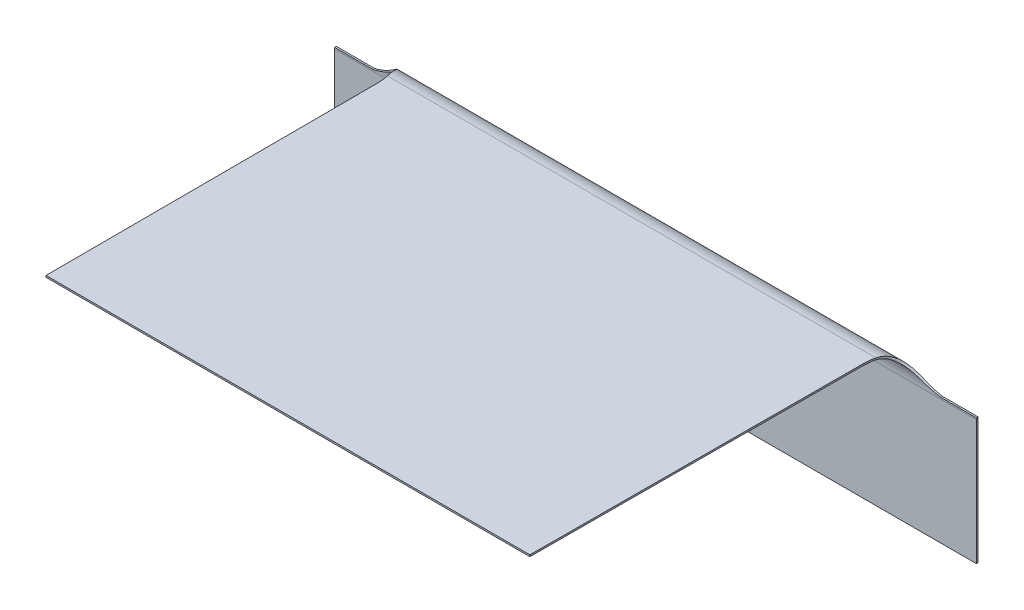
ISO-10303-21;
HEADER;
FILE_DESCRIPTION(('STEP AP214'),'2;1');
FILE_NAME('part.step','',(''),(''),'','','');
FILE_SCHEMA(('AUTOMOTIVE_DESIGN { 1 0 10303 214 1 1 1 1 }'));
ENDSEC;
DATA;
#1=APPLICATION_CONTEXT('core data for automotive mechanical design processes');
#2=APPLICATION_PROTOCOL_DEFINITION('international standard','automotive_design',2000,#1);
#3=PRODUCT_CONTEXT('',#1,'mechanical');
#4=PRODUCT('Part','Part','',(#3));
#5=PRODUCT_RELATED_PRODUCT_CATEGORY('part','',(#4));
#6=PRODUCT_DEFINITION_FORMATION('','',#4);
#7=PRODUCT_DEFINITION_CONTEXT('part definition',#1,'design');
#8=PRODUCT_DEFINITION('design','',#6,#7);
#9=PRODUCT_DEFINITION_SHAPE('','',#8);
#10=(LENGTH_UNIT() NAMED_UNIT(*) SI_UNIT(.MILLI.,.METRE.));
#11=(NAMED_UNIT(*) PLANE_ANGLE_UNIT() SI_UNIT($,.RADIAN.));
#12=(NAMED_UNIT(*) SI_UNIT($,.STERADIAN.) SOLID_ANGLE_UNIT());
#13=UNCERTAINTY_MEASURE_WITH_UNIT(LENGTH_MEASURE(1.E-05),#10,'distance_accuracy_value','');
#14=(GEOMETRIC_REPRESENTATION_CONTEXT(3) GLOBAL_UNCERTAINTY_ASSIGNED_CONTEXT((#13)) GLOBAL_UNIT_ASSIGNED_CONTEXT((#10,
#11,#12)) REPRESENTATION_CONTEXT('',''));
#15=CARTESIAN_POINT('',(0.,0.,0.));
#16=DIRECTION('',(0.,0.,1.));
#17=DIRECTION('',(1.,0.,0.));
#18=AXIS2_PLACEMENT_3D('',#15,#16,#17);
#19=CARTESIAN_POINT('',(317.5,-12.7,-174.768814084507));
#20=DIRECTION('',(0.,0.,-1.));
#21=DIRECTION('',(0.,1.,0.));
#22=AXIS2_PLACEMENT_3D('',#19,#20,#21);
#23=PLANE('',#22);
#24=DIRECTION('',(0.,-1.,0.));
#25=VECTOR('',#24,1.);
#26=CARTESIAN_POINT('',(0.,-12.7,-174.768814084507));
#27=LINE('',#26,#25);
#28=CARTESIAN_POINT('',(0.,-12.7,-174.768814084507));
#29=VERTEX_POINT('',#28);
#30=CARTESIAN_POINT('',(0.,-74.3966,-174.768814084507));
#31=VERTEX_POINT('',#30);
#32=EDGE_CURVE('E1224',#29,#31,#27,.T.);
#33=ORIENTED_EDGE('',*,*,#32,.T.);
#34=DIRECTION('',(-1.,0.,0.));
#35=VECTOR('',#34,1.);
#36=CARTESIAN_POINT('',(317.5,-74.3966,-174.768814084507));
#37=LINE('',#36,#35);
#38=CARTESIAN_POINT('',(317.5,-74.3966,-174.768814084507));
#39=VERTEX_POINT('',#38);
#40=EDGE_CURVE('E1203',#39,#31,#37,.T.);
#41=ORIENTED_EDGE('',*,*,#40,.F.);
#42=DIRECTION('',(0.,-1.,0.));
#43=VECTOR('',#42,1.);
#44=CARTESIAN_POINT('',(317.5,-12.7,-174.768814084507));
#45=LINE('',#44,#43);
#46=CARTESIAN_POINT('',(317.5,-12.7,-174.768814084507));
#47=VERTEX_POINT('',#46);
#48=EDGE_CURVE('E1230',#47,#39,#45,.T.);
#49=ORIENTED_EDGE('',*,*,#48,.F.);
#50=DIRECTION('',(-1.,0.,0.));
#51=VECTOR('',#50,1.);
#52=CARTESIAN_POINT('',(317.5,-12.7,-174.768814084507));
#53=LINE('',#52,#51);
#54=EDGE_CURVE('E1206',#47,#29,#53,.T.);
#55=ORIENTED_EDGE('',*,*,#54,.T.);
#56=EDGE_LOOP('',(#33,#41,#49,#55));
#57=FACE_BOUND('',#56,.T.);
#58=ADVANCED_FACE('F1016',(#57),#23,.F.);
#59=CARTESIAN_POINT('',(317.5,-74.3966,-174.768814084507));
#60=DIRECTION('',(0.,1.,0.));
#61=DIRECTION('',(0.,0.,1.));
#62=AXIS2_PLACEMENT_3D('',#59,#60,#61);
#63=PLANE('',#62);
#64=DIRECTION('',(0.,0.,-1.));
#65=VECTOR('',#64,1.);
#66=CARTESIAN_POINT('',(0.,-74.3966,-174.768814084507));
#67=LINE('',#66,#65);
#68=CARTESIAN_POINT('',(0.,-74.3966,-175.581614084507));
#69=VERTEX_POINT('',#68);
#70=EDGE_CURVE('E1222',#31,#69,#67,.T.);
#71=ORIENTED_EDGE('',*,*,#70,.T.);
#72=DIRECTION('',(-1.,0.,0.));
#73=VECTOR('',#72,1.);
#74=CARTESIAN_POINT('',(317.5,-74.3966,-175.581614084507));
#75=LINE('',#74,#73);
#76=CARTESIAN_POINT('',(317.5,-74.3966,-175.581614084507));
#77=VERTEX_POINT('',#76);
#78=EDGE_CURVE('E1189',#77,#69,#75,.T.);
#79=ORIENTED_EDGE('',*,*,#78,.F.);
#80=DIRECTION('',(0.,0.,-1.));
#81=VECTOR('',#80,1.);
#82=CARTESIAN_POINT('',(317.5,-74.3966,-174.768814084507));
#83=LINE('',#82,#81);
#84=EDGE_CURVE('E1043',#39,#77,#83,.T.);
#85=ORIENTED_EDGE('',*,*,#84,.F.);
#86=ORIENTED_EDGE('',*,*,#40,.T.);
#87=EDGE_LOOP('',(#71,#79,#85,#86));
#88=FACE_BOUND('',#87,.T.);
#89=ADVANCED_FACE('F1501',(#88),#63,.F.);
#90=CARTESIAN_POINT('',(317.5,-12.7,-162.068814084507));
#91=DIRECTION('',(1.,0.,0.));
#92=DIRECTION('',(0.,0.,-1.));
#93=AXIS2_PLACEMENT_3D('',#90,#91,#92);
#94=PLANE('',#93);
#95=DIRECTION('',(0.,0.,-1.));
#96=VECTOR('',#95,1.);
#97=CARTESIAN_POINT('',(317.5,-11.8872,-162.068814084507));
#98=LINE('',#97,#96);
#99=CARTESIAN_POINT('',(317.5,-11.8872,-174.742777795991));
#100=VERTEX_POINT('',#99);
#101=CARTESIAN_POINT('',(317.5,-11.8872,-175.581614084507));
#102=VERTEX_POINT('',#101);
#103=EDGE_CURVE('E13',#100,#102,#98,.T.);
#104=ORIENTED_EDGE('',*,*,#103,.F.);
#105=CARTESIAN_POINT('',(317.5,-12.7,-162.068814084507));
#106=DIRECTION('',(-1.,0.,0.));
#107=DIRECTION('',(0.,0.,-1.));
#108=AXIS2_PLACEMENT_3D('',#105,#106,#107);
#109=CIRCLE('',#108,12.7);
#110=EDGE_CURVE('E1068',#100,#47,#109,.T.);
#111=ORIENTED_EDGE('',*,*,#110,.T.);
#112=ORIENTED_EDGE('',*,*,#48,.T.);
#113=ORIENTED_EDGE('',*,*,#84,.T.);
#114=DIRECTION('',(0.,1.,0.));
#115=VECTOR('',#114,1.);
#116=CARTESIAN_POINT('',(317.5,-74.3966,-175.581614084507));
#117=LINE('',#116,#115);
#118=EDGE_CURVE('E1217',#77,#102,#117,.T.);
#119=ORIENTED_EDGE('',*,*,#118,.T.);
#120=EDGE_LOOP('',(#104,#111,#112,#113,#119));
#121=FACE_BOUND('',#120,.T.);
#122=ADVANCED_FACE('F1498',(#121),#94,.T.);
#123=CARTESIAN_POINT('',(317.5,0.812800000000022,-162.881614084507));
#124=DIRECTION('',(0.,-1.,0.));
#125=DIRECTION('',(0.,0.,-1.));
#126=AXIS2_PLACEMENT_3D('',#123,#124,#125);
#127=PLANE('',#126);
#128=CARTESIAN_POINT('',(38.0166994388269,0.812800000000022,-162.881614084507));
#129=CARTESIAN_POINT('',(38.0889864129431,0.812800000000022,-162.539831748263));
#130=CARTESIAN_POINT('',(38.4720376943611,0.812800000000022,-160.728714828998));
#131=CARTESIAN_POINT('',(38.5538772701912,0.812800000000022,-158.874154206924));
#132=CARTESIAN_POINT('',(38.6202726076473,0.812800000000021,-157.369574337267));
#133=B_SPLINE_CURVE_WITH_KNOTS('',3,(#128,#129,#130,#131,#132),.UNSPECIFIED.,.F.,.F.,(4,1,4),
(0.,0.188713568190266,1.),.UNSPECIFIED.);
#134=CARTESIAN_POINT('',(38.0166994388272,0.81280000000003,-162.881614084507));
#135=VERTEX_POINT('',#134);
#136=CARTESIAN_POINT('',(38.6202726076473,0.812800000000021,-157.369574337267));
#137=VERTEX_POINT('',#136);
#138=EDGE_CURVE('E1320',#135,#137,#133,.T.);
#139=ORIENTED_EDGE('',*,*,#138,.T.);
#140=CARTESIAN_POINT('',(38.6202726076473,0.812800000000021,-157.369574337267));
#141=CARTESIAN_POINT('',(38.6160118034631,0.812800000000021,-154.881647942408));
#142=CARTESIAN_POINT('',(38.6074840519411,0.81280000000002,-149.902208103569));
#143=CARTESIAN_POINT('',(38.6204269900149,0.812800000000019,-142.430015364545));
#144=CARTESIAN_POINT('',(38.6328821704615,0.812800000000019,-134.952628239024));
#145=CARTESIAN_POINT('',(38.6455969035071,0.812800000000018,-127.473207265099));
#146=CARTESIAN_POINT('',(38.6607453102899,0.812800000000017,-119.992888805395));
#147=CARTESIAN_POINT('',(38.6754094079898,0.812800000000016,-112.511953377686));
#148=CARTESIAN_POINT('',(38.6915887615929,0.812800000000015,-105.030872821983));
#149=CARTESIAN_POINT('',(38.7073905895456,0.812800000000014,-97.5498016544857));
#150=CARTESIAN_POINT('',(38.7244178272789,0.812800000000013,-90.0690432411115));
#151=CARTESIAN_POINT('',(38.7411990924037,0.812800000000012,-82.5887365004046));
#152=CARTESIAN_POINT('',(38.7592841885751,0.812800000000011,-75.1090657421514));
#153=CARTESIAN_POINT('',(38.777598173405,0.81280000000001,-67.6300147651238));
#154=CARTESIAN_POINT('',(38.7971738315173,0.812800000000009,-60.1515849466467));
#155=CARTESIAN_POINT('',(38.8174953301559,0.812800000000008,-52.6737263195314));
#156=CARTESIAN_POINT('',(38.8386782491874,0.812800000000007,-45.1964894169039));
#157=CARTESIAN_POINT('',(38.8615050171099,0.812800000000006,-37.7197995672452));
#158=CARTESIAN_POINT('',(38.8844349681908,0.812800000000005,-30.244052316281));
#159=CARTESIAN_POINT('',(38.9102201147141,0.812800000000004,-22.7691789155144));
#160=CARTESIAN_POINT('',(38.936846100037,0.812800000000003,-15.2953794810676));
#161=CARTESIAN_POINT('',(38.9644523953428,0.812800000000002,-7.82263809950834));
#162=CARTESIAN_POINT('',(38.9949404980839,0.812800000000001,-0.350761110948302));
#163=CARTESIAN_POINT('',(39.0152527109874,0.8128,4.63012493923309));
#164=CARTESIAN_POINT('',(39.0254088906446,0.8128,7.12058591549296));
#165=B_SPLINE_CURVE_WITH_KNOTS('',3,(#140,#141,#142,#143,#144,#145,#146,#147,#148,#149,#150,
#151,#152,#153,#154,#155,#156,#157,#158,#159,#160,#161,#162,#163,#164),.UNSPECIFIED.,.F.,.F.,(4,
1,1,1,1,1,1,1,1,1,1,1,1,1,1,1,1,1,1,1,1,1,4),(0.,0.0453750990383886,0.0908156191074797,
0.136278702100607,0.181748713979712,0.227226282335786,0.27270583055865,0.31818707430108,
0.363667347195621,0.409146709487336,0.454622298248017,0.500094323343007,0.545562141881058,
0.59102643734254,0.636487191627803,0.681944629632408,0.727397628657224,0.772848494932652,
0.818288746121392,0.863725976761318,0.909157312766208,0.954578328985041,1.),.UNSPECIFIED.);
#166=CARTESIAN_POINT('',(39.0254088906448,0.8128,7.12058591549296));
#167=VERTEX_POINT('',#166);
#168=EDGE_CURVE('E1322',#137,#167,#165,.T.);
#169=ORIENTED_EDGE('',*,*,#168,.T.);
#170=DIRECTION('',(-1.,0.,0.));
#171=VECTOR('',#170,1.);
#172=CARTESIAN_POINT('',(317.5,0.8128,7.12058591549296));
#173=LINE('',#172,#171);
#174=CARTESIAN_POINT('',(278.467382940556,0.8128,7.12058591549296));
#175=VERTEX_POINT('',#174);
#176=EDGE_CURVE('E1191',#175,#167,#173,.T.);
#177=ORIENTED_EDGE('',*,*,#176,.F.);
#178=CARTESIAN_POINT('',(279.033699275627,0.812800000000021,-157.255923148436));
#179=CARTESIAN_POINT('',(279.031887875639,0.812800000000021,-154.767986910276));
#180=CARTESIAN_POINT('',(279.028263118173,0.81280000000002,-149.789425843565));
#181=CARTESIAN_POINT('',(278.997446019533,0.812800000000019,-142.31911418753));
#182=CARTESIAN_POINT('',(278.967666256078,0.812800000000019,-134.845148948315));
#183=CARTESIAN_POINT('',(278.937968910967,0.812800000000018,-127.370434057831));
#184=CARTESIAN_POINT('',(278.908581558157,0.812800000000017,-119.896148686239));
#185=CARTESIAN_POINT('',(278.878926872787,0.812800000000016,-112.422120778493));
#186=CARTESIAN_POINT('',(278.850321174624,0.812800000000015,-104.948221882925));
#187=CARTESIAN_POINT('',(278.821690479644,0.812800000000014,-97.4746760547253));
#188=CARTESIAN_POINT('',(278.794276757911,0.812800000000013,-90.0016543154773));
#189=CARTESIAN_POINT('',(278.767219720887,0.812800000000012,-82.5293361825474));
#190=CARTESIAN_POINT('',(278.740985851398,0.812800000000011,-75.0576658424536));
#191=CARTESIAN_POINT('',(278.715404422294,0.81280000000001,-67.5865817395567));
#192=CARTESIAN_POINT('',(278.690119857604,0.812800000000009,-60.1158180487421));
#193=CARTESIAN_POINT('',(278.665542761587,0.812800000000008,-52.6452189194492));
#194=CARTESIAN_POINT('',(278.641205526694,0.812800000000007,-45.1745682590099));
#195=CARTESIAN_POINT('',(278.617746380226,0.812800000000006,-37.7037980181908));
#196=CARTESIAN_POINT('',(278.594049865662,0.812800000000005,-30.2331213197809));
#197=CARTESIAN_POINT('',(278.570983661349,0.812800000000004,-22.7625121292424));
#198=CARTESIAN_POINT('',(278.545708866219,0.812800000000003,-15.2920003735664));
#199=CARTESIAN_POINT('',(278.521373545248,0.812800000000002,-7.82138192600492));
#200=CARTESIAN_POINT('',(278.495196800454,0.812800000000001,-0.350508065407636));
#201=CARTESIAN_POINT('',(278.476654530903,0.8128,4.63013967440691));
#202=CARTESIAN_POINT('',(278.467382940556,0.8128,7.12058591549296));
#203=B_SPLINE_CURVE_WITH_KNOTS('',3,(#178,#179,#180,#181,#182,#183,#184,#185,#186,#187,#188,
#189,#190,#191,#192,#193,#194,#195,#196,#197,#198,#199,#200,#201,#202),.UNSPECIFIED.,.F.,.F.,(4,
1,1,1,1,1,1,1,1,1,1,1,1,1,1,1,1,1,1,1,1,1,4),(0.,0.0454064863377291,0.0908620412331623,
0.136339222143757,0.181812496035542,0.227281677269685,0.272751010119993,0.318219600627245,
0.363686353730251,0.409149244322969,0.454608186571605,0.500062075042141,0.545513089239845,
0.590961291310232,0.636409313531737,0.68185728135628,0.727306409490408,0.772756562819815,
0.818202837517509,0.863650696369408,0.90909920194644,0.9545473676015,1.),.UNSPECIFIED.);
#204=CARTESIAN_POINT('',(279.033699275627,0.812800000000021,-157.255923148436));
#205=VERTEX_POINT('',#204);
#206=EDGE_CURVE('E1391',#205,#175,#203,.T.);
#207=ORIENTED_EDGE('',*,*,#206,.F.);
#208=CARTESIAN_POINT('',(279.67874042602,0.812800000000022,-162.881614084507));
#209=CARTESIAN_POINT('',(279.595748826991,0.812800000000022,-162.501224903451));
#210=CARTESIAN_POINT('',(279.192701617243,0.812800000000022,-160.6538716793));
#211=CARTESIAN_POINT('',(279.104075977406,0.812800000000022,-158.759903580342));
#212=CARTESIAN_POINT('',(279.033699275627,0.812800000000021,-157.255923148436));
#213=B_SPLINE_CURVE_WITH_KNOTS('',3,(#208,#209,#210,#211,#212),.UNSPECIFIED.,.F.,.F.,(4,1,4),
(0.,0.205910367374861,1.),.UNSPECIFIED.);
#214=CARTESIAN_POINT('',(279.67874042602,0.81280000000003,-162.881614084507));
#215=VERTEX_POINT('',#214);
#216=EDGE_CURVE('E1476',#215,#205,#213,.T.);
#217=ORIENTED_EDGE('',*,*,#216,.F.);
#218=DIRECTION('',(-1.,0.,0.));
#219=VECTOR('',#218,1.);
#220=CARTESIAN_POINT('',(317.5,0.81280000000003,-162.881614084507));
#221=LINE('',#220,#219);
#222=EDGE_CURVE('E1186',#215,#135,#221,.T.);
#223=ORIENTED_EDGE('',*,*,#222,.T.);
#224=EDGE_LOOP('',(#139,#169,#177,#207,#217,#223));
#225=FACE_BOUND('',#224,.T.);
#226=ADVANCED_FACE('F1349',(#225),#127,.F.);
#227=CARTESIAN_POINT('',(317.5,-11.8872,-162.881614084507));
#228=DIRECTION('',(-1.,0.,0.));
#229=DIRECTION('',(0.,0.,1.));
#230=AXIS2_PLACEMENT_3D('',#227,#228,#229);
#231=CYLINDRICAL_SURFACE('',#230,12.7);
#232=DIRECTION('',(-1.,0.,0.));
#233=VECTOR('',#232,1.);
#234=CARTESIAN_POINT('',(317.5,-11.8872,-175.581614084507));
#235=LINE('',#234,#233);
#236=CARTESIAN_POINT('',(299.847489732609,-11.8872,-175.581614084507));
#237=VERTEX_POINT('',#236);
#238=CARTESIAN_POINT('',(18.795215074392,-11.8872,-175.581614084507));
#239=VERTEX_POINT('',#238);
#240=EDGE_CURVE('E1178',#237,#239,#235,.T.);
#241=ORIENTED_EDGE('',*,*,#240,.T.);
#242=CARTESIAN_POINT('',(38.016699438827,0.812800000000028,-162.881614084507));
#243=CARTESIAN_POINT('',(37.9334995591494,0.812800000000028,-163.176674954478));
#244=CARTESIAN_POINT('',(37.8499248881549,0.802513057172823,-163.471735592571));
#245=CARTESIAN_POINT('',(37.7607285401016,0.780679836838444,-163.784476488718));
#246=CARTESIAN_POINT('',(37.7540197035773,0.778986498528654,-163.807978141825));
#247=CARTESIAN_POINT('',(37.7421895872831,0.775890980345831,-163.849373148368));
#248=CARTESIAN_POINT('',(37.7363163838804,0.77430474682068,-163.869902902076));
#249=CARTESIAN_POINT('',(37.7188223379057,0.769437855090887,-163.930988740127));
#250=CARTESIAN_POINT('',(37.707327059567,0.766049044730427,-163.971041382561));
#251=CARTESIAN_POINT('',(37.6733434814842,0.755506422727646,-164.089184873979));
#252=CARTESIAN_POINT('',(37.6513574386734,0.747977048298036,-164.165261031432));
#253=CARTESIAN_POINT('',(37.5874083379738,0.724315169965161,-164.385435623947));
#254=CARTESIAN_POINT('',(37.5474543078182,0.707119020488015,-164.521477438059));
#255=CARTESIAN_POINT('',(37.5078492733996,0.688425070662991,-164.65466700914));
#256=CARTESIAN_POINT('',(37.5042340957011,0.686708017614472,-164.666813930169));
#257=CARTESIAN_POINT('',(37.4982950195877,0.683862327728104,-164.686743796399));
#258=CARTESIAN_POINT('',(37.4953274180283,0.682429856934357,-164.696691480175));
#259=CARTESIAN_POINT('',(37.4864304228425,0.678103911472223,-164.726482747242));
#260=CARTESIAN_POINT('',(37.480506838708,0.675181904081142,-164.746274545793));
#261=CARTESIAN_POINT('',(37.4627593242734,0.666304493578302,-164.805442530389));
#262=CARTESIAN_POINT('',(37.4509586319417,0.660237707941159,-164.844611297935));
#263=CARTESIAN_POINT('',(37.4156495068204,0.641613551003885,-164.961286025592));
#264=CARTESIAN_POINT('',(37.3922340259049,0.62863247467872,-165.037960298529));
#265=CARTESIAN_POINT('',(37.3223593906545,0.588164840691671,-165.264645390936));
#266=CARTESIAN_POINT('',(37.2762720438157,0.559155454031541,-165.411316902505));
#267=CARTESIAN_POINT('',(37.1394972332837,0.467342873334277,-165.837948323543));
#268=CARTESIAN_POINT('',(37.0502969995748,0.399781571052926,-166.104506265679));
#269=CARTESIAN_POINT('',(36.9603541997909,0.326837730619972,-166.361175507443));
#270=CARTESIAN_POINT('',(36.9565378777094,0.323735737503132,-166.372049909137));
#271=CARTESIAN_POINT('',(36.9499891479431,0.318397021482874,-166.39067310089));
#272=CARTESIAN_POINT('',(36.9467124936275,0.315718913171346,-166.399975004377));
#273=CARTESIAN_POINT('',(36.9368756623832,0.30765849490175,-166.42785160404));
#274=CARTESIAN_POINT('',(36.930308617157,0.302250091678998,-166.446397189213));
#275=CARTESIAN_POINT('',(36.9105800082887,0.285921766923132,-166.50191723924));
#276=CARTESIAN_POINT('',(36.8973909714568,0.274898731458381,-166.538774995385));
#277=CARTESIAN_POINT('',(36.8577139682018,0.241427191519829,-166.648879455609));
#278=CARTESIAN_POINT('',(36.8311161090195,0.218576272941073,-166.721657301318));
#279=CARTESIAN_POINT('',(36.750882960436,0.148493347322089,-166.938101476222));
#280=CARTESIAN_POINT('',(36.696808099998,0.0997315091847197,-167.079877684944));
#281=CARTESIAN_POINT('',(36.5328252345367,-0.0520492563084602,-167.497562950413));
#282=CARTESIAN_POINT('',(36.4211589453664,-0.160557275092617,-167.765817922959));
#283=CARTESIAN_POINT('',(36.0791269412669,-0.50325542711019,-168.539722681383));
#284=CARTESIAN_POINT('',(35.8417280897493,-0.7545060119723,-169.014384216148));
#285=CARTESIAN_POINT('',(35.5872399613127,-1.02523993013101,-169.46250119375));
#286=CARTESIAN_POINT('',(35.5773943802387,-1.03571575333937,-169.479766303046));
#287=CARTESIAN_POINT('',(35.559803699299,-1.05443530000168,-169.510455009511));
#288=CARTESIAN_POINT('',(35.5509972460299,-1.0638081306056,-169.525747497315));
#289=CARTESIAN_POINT('',(35.5245445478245,-1.09196432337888,-169.571469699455));
#290=CARTESIAN_POINT('',(35.5068649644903,-1.11078538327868,-169.601744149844));
#291=CARTESIAN_POINT('',(35.453692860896,-1.16738770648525,-169.691949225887));
#292=CARTESIAN_POINT('',(35.4180669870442,-1.20530806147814,-169.75126153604));
#293=CARTESIAN_POINT('',(35.3106559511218,-1.31953420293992,-169.926748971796));
#294=CARTESIAN_POINT('',(35.2383373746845,-1.39630423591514,-170.04047403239));
#295=CARTESIAN_POINT('',(35.0192479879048,-1.62777127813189,-170.372061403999));
#296=CARTESIAN_POINT('',(34.870343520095,-1.78361210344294,-170.580329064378));
#297=CARTESIAN_POINT('',(34.5668448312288,-2.09493186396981,-170.972608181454));
#298=CARTESIAN_POINT('',(34.4037025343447,-2.25865927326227,-171.16683695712));
#299=CARTESIAN_POINT('',(34.0607164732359,-2.59547745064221,-171.542884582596));
#300=CARTESIAN_POINT('',(33.8798586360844,-2.76960837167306,-171.726014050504));
#301=CARTESIAN_POINT('',(33.6777470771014,-2.96039638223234,-171.915020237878));
#302=CARTESIAN_POINT('',(33.6676809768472,-2.96988745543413,-171.924387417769));
#303=CARTESIAN_POINT('',(33.6456142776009,-2.99067360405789,-171.944838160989));
#304=CARTESIAN_POINT('',(33.6345437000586,-3.0010907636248,-171.955052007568));
#305=CARTESIAN_POINT('',(33.6012202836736,-3.03241450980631,-171.985658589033));
#306=CARTESIAN_POINT('',(33.5788557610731,-3.05339336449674,-172.006016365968));
#307=CARTESIAN_POINT('',(33.5113154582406,-3.1166190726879,-172.066946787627));
#308=CARTESIAN_POINT('',(33.4656929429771,-3.15915507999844,-172.107376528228));
#309=CARTESIAN_POINT('',(33.3270384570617,-3.28791994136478,-172.228069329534));
#310=CARTESIAN_POINT('',(33.2322195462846,-3.37530579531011,-172.307736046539));
#311=CARTESIAN_POINT('',(33.0378165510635,-3.55316019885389,-172.465345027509));
#312=CARTESIAN_POINT('',(32.9382324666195,-3.64362875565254,-172.543287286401));
#313=CARTESIAN_POINT('',(32.7852824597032,-3.78163780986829,-172.658804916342));
#314=CARTESIAN_POINT('',(32.7311694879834,-3.83029006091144,-172.698907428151));
#315=CARTESIAN_POINT('',(32.635658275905,-3.91592417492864,-172.768565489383));
#316=CARTESIAN_POINT('',(32.5874513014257,-3.95903422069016,-172.803169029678));
#317=CARTESIAN_POINT('',(32.1495262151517,-4.34964720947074,-173.112521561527));
#318=CARTESIAN_POINT('',(31.7313718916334,-4.71554307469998,-173.372718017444));
#319=CARTESIAN_POINT('',(31.1725695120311,-5.19495427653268,-173.675905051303));
#320=CARTESIAN_POINT('',(31.0626889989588,-5.28869945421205,-173.733426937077));
#321=CARTESIAN_POINT('',(30.8402361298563,-5.47727957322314,-173.84587291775));
#322=CARTESIAN_POINT('',(30.7287390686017,-5.57119199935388,-173.900213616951));
#323=CARTESIAN_POINT('',(30.3934360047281,-5.85155502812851,-174.057792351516));
#324=CARTESIAN_POINT('',(30.1688181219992,-6.03662650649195,-174.155586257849));
#325=CARTESIAN_POINT('',(29.491716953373,-6.58457859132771,-174.428857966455));
#326=CARTESIAN_POINT('',(29.0359861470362,-6.94012714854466,-174.584227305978));
#327=CARTESIAN_POINT('',(28.5471715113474,-7.30352296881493,-174.725618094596));
#328=CARTESIAN_POINT('',(28.5151228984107,-7.32727644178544,-174.734785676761));
#329=CARTESIAN_POINT('',(28.4542365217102,-7.37225024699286,-174.751989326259));
#330=CARTESIAN_POINT('',(28.4237653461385,-7.39468489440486,-174.760497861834));
#331=CARTESIAN_POINT('',(28.3322678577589,-7.4618295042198,-174.785747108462));
#332=CARTESIAN_POINT('',(28.2711575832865,-7.50638011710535,-174.802211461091));
#333=CARTESIAN_POINT('',(28.0874909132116,-7.63937466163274,-174.850527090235));
#334=CARTESIAN_POINT('',(27.9645986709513,-7.72716103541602,-174.881300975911));
#335=CARTESIAN_POINT('',(27.594578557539,-7.98774057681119,-174.969535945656));
#336=CARTESIAN_POINT('',(27.3461072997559,-8.15775026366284,-175.022911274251));
#337=CARTESIAN_POINT('',(26.5953199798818,-8.65559929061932,-175.168449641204));
#338=CARTESIAN_POINT('',(26.0876303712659,-8.97120647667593,-175.246048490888));
#339=CARTESIAN_POINT('',(25.540597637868,-9.28699192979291,-175.312594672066));
#340=CARTESIAN_POINT('',(25.5055266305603,-9.30714016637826,-175.316793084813));
#341=CARTESIAN_POINT('',(25.4382232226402,-9.34560262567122,-175.324711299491));
#342=CARTESIAN_POINT('',(25.40455351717,-9.36474656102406,-175.328605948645));
#343=CARTESIAN_POINT('',(25.3034903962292,-9.42191505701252,-175.340100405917));
#344=CARTESIAN_POINT('',(25.2360429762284,-9.45967629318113,-175.347510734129));
#345=CARTESIAN_POINT('',(25.0334846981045,-9.57189582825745,-175.369014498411));
#346=CARTESIAN_POINT('',(24.8981578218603,-9.6452897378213,-175.382380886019));
#347=CARTESIAN_POINT('',(24.4913131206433,-9.86113507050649,-175.419811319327));
#348=CARTESIAN_POINT('',(24.2189312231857,-9.99924709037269,-175.441209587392));
#349=CARTESIAN_POINT('',(23.3983292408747,-10.395713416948,-175.496553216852));
#350=CARTESIAN_POINT('',(22.8466528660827,-10.6361630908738,-175.521699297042));
#351=CARTESIAN_POINT('',(22.2208325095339,-10.878850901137,-175.541549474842));
#352=CARTESIAN_POINT('',(22.1464590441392,-10.9072459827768,-175.543779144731));
#353=CARTESIAN_POINT('',(22.0025265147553,-10.9612739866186,-175.547844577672));
#354=CARTESIAN_POINT('',(21.9305524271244,-10.987843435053,-175.549756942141));
#355=CARTESIAN_POINT('',(21.7146066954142,-11.0662147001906,-175.555158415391));
#356=CARTESIAN_POINT('',(21.5706115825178,-11.1166793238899,-175.558312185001));
#357=CARTESIAN_POINT('',(21.1385323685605,-11.262701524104,-175.566625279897));
#358=CARTESIAN_POINT('',(20.8503543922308,-11.3528860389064,-175.570640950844));
#359=CARTESIAN_POINT('',(20.5440323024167,-11.441051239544,-175.573776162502));
#360=CARTESIAN_POINT('',(20.5294776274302,-11.4452170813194,-175.573921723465));
#361=CARTESIAN_POINT('',(20.4965050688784,-11.4546141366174,-175.574245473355));
#362=CARTESIAN_POINT('',(20.4798858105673,-11.4593276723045,-175.574405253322));
#363=CARTESIAN_POINT('',(20.4296290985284,-11.4735132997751,-175.574878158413));
#364=CARTESIAN_POINT('',(20.395592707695,-11.4830304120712,-175.57518484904));
#365=CARTESIAN_POINT('',(20.291887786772,-11.511761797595,-175.576077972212));
#366=CARTESIAN_POINT('',(20.22062350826,-11.5311561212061,-175.576637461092));
#367=CARTESIAN_POINT('',(20.0004476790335,-11.5900589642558,-175.578198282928));
#368=CARTESIAN_POINT('',(19.8451531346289,-11.6302873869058,-175.579082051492));
#369=CARTESIAN_POINT('',(19.6762290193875,-11.6727615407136,-175.579803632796));
#370=CARTESIAN_POINT('',(19.6751690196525,-11.6730274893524,-175.579808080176));
#371=CARTESIAN_POINT('',(19.6689180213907,-11.6745969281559,-175.579834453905));
#372=CARTESIAN_POINT('',(19.6657684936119,-11.6753871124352,-175.579847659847));
#373=CARTESIAN_POINT('',(19.6562478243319,-11.6777740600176,-175.579887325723));
#374=CARTESIAN_POINT('',(19.6498045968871,-11.6793872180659,-175.579913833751));
#375=CARTESIAN_POINT('',(19.6301865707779,-11.6842922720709,-175.579993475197));
#376=CARTESIAN_POINT('',(19.6167234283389,-11.6876497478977,-175.580046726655));
#377=CARTESIAN_POINT('',(19.5751806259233,-11.6979845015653,-175.580206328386));
#378=CARTESIAN_POINT('',(19.5459475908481,-11.7052241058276,-175.580312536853));
#379=CARTESIAN_POINT('',(19.4536349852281,-11.7279922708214,-175.580625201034));
#380=CARTESIAN_POINT('',(19.385941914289,-11.7445701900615,-175.580825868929));
#381=CARTESIAN_POINT('',(19.1644086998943,-11.7985015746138,-175.581355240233));
#382=CARTESIAN_POINT('',(18.992114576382,-11.840052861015,-175.581614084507));
#383=CARTESIAN_POINT('',(18.7952150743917,-11.8872,-175.581614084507));
#384=B_SPLINE_CURVE_WITH_KNOTS('',3,(#242,#243,#244,#245,#246,#247,#248,#249,#250,#251,#252,
#253,#254,#255,#256,#257,#258,#259,#260,#261,#262,#263,#264,#265,#266,#267,#268,#269,#270,#271,
#272,#273,#274,#275,#276,#277,#278,#279,#280,#281,#282,#283,#284,#285,#286,#287,#288,#289,#290,
#291,#292,#293,#294,#295,#296,#297,#298,#299,#300,#301,#302,#303,#304,#305,#306,#307,#308,#309,
#310,#311,#312,#313,#314,#315,#316,#317,#318,#319,#320,#321,#322,#323,#324,#325,#326,#327,#328,
#329,#330,#331,#332,#333,#334,#335,#336,#337,#338,#339,#340,#341,#342,#343,#344,#345,#346,#347,
#348,#349,#350,#351,#352,#353,#354,#355,#356,#357,#358,#359,#360,#361,#362,#363,#364,#365,#366,
#367,#368,#369,#370,#371,#372,#373,#374,#375,#376,#377,#378,#379,#380,#381,#382,#383),
.UNSPECIFIED.,.F.,.F.,(4,2,2,2,2,2,2,2,2,2,2,2,2,2,2,2,2,2,2,2,2,2,2,2,2,2,2,2,2,2,2,2,2,2,2,2,
2,2,2,2,2,2,2,2,2,2,2,2,2,2,2,2,2,2,2,2,2,2,2,2,2,2,2,2,2,2,2,2,2,2,4),(0.,0.03125,0.033203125,
0.03515625,0.0390625,0.046875,0.0625,0.0634765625,0.064453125,0.06640625,0.0703125,0.078125,
0.09375,0.125,0.1259765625,0.126953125,0.12890625,0.1328125,0.140625,0.15625,0.1875,0.25,
0.251953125,0.25390625,0.2578125,0.265625,0.28125,0.3125,0.34375,0.375,0.376953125,0.37890625,
0.3828125,0.390625,0.40625,0.421875,0.4296875,0.4375,0.5,0.515625,0.53125,0.5625,0.625,
0.62890625,0.6328125,0.640625,0.65625,0.6875,0.75,0.75390625,0.7578125,0.765625,0.78125,0.8125,
0.875,0.8828125,0.890625,0.90625,0.9375,0.939453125,0.94140625,0.9453125,0.953125,0.96875,
0.96923828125,0.9697265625,0.970703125,0.97265625,0.9765625,0.984375,1.),.UNSPECIFIED.);
#385=EDGE_CURVE('E1158',#239,#135,#384,.F.);
#386=ORIENTED_EDGE('',*,*,#385,.T.);
#387=ORIENTED_EDGE('',*,*,#222,.F.);
#388=CARTESIAN_POINT('',(299.847489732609,-11.8872,-175.581614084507));
#389=CARTESIAN_POINT('',(299.643418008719,-11.8473835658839,-175.581614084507));
#390=CARTESIAN_POINT('',(299.46482685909,-11.8123149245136,-175.581429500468));
#391=CARTESIAN_POINT('',(299.235160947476,-11.7668347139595,-175.581052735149));
#392=CARTESIAN_POINT('',(299.164975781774,-11.7528617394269,-175.580909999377));
#393=CARTESIAN_POINT('',(299.069253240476,-11.733682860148,-175.580687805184));
#394=CARTESIAN_POINT('',(299.038938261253,-11.7275866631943,-175.580612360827));
#395=CARTESIAN_POINT('',(298.995854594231,-11.7188874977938,-175.580499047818));
#396=CARTESIAN_POINT('',(298.981891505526,-11.716061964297,-175.580461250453));
#397=CARTESIAN_POINT('',(298.961544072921,-11.7119349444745,-175.580404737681));
#398=CARTESIAN_POINT('',(298.954861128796,-11.7105778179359,-175.580385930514));
#399=CARTESIAN_POINT('',(298.94498601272,-11.7085699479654,-175.580357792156));
#400=CARTESIAN_POINT('',(298.941719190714,-11.7079052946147,-175.58034842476));
#401=CARTESIAN_POINT('',(298.935235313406,-11.7065852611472,-175.580329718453));
#402=CARTESIAN_POINT('',(298.934136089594,-11.7063616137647,-175.580326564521));
#403=CARTESIAN_POINT('',(298.758905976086,-11.6706398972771,-175.579814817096));
#404=CARTESIAN_POINT('',(298.597700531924,-11.636884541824,-175.579189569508));
#405=CARTESIAN_POINT('',(298.368964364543,-11.5875783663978,-175.578089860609));
#406=CARTESIAN_POINT('',(298.294897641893,-11.5713641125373,-175.577696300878));
#407=CARTESIAN_POINT('',(298.187065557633,-11.5473745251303,-175.577069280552));
#408=CARTESIAN_POINT('',(298.151666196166,-11.5394332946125,-175.576854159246));
#409=CARTESIAN_POINT('',(298.099384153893,-11.5276044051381,-175.576522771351));
#410=CARTESIAN_POINT('',(298.082092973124,-11.5236752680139,-175.576410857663));
#411=CARTESIAN_POINT('',(298.056360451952,-11.5178023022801,-175.576240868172));
#412=CARTESIAN_POINT('',(298.047816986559,-11.5158481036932,-175.576183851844));
#413=CARTESIAN_POINT('',(298.030798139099,-11.5119466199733,-175.576069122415));
#414=CARTESIAN_POINT('',(298.023981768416,-11.510381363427,-175.576022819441));
#415=CARTESIAN_POINT('',(297.85227578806,-11.470841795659,-175.574841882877));
#416=CARTESIAN_POINT('',(297.695847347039,-11.4332481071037,-175.573555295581));
#417=CARTESIAN_POINT('',(297.468970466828,-11.3762903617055,-175.571347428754));
#418=CARTESIAN_POINT('',(297.394639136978,-11.3572099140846,-175.570565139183));
#419=CARTESIAN_POINT('',(297.285083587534,-11.328447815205,-175.569320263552));
#420=CARTESIAN_POINT('',(297.248888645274,-11.3188368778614,-175.568893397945));
#421=CARTESIAN_POINT('',(297.177145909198,-11.2995679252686,-175.568015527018));
#422=CARTESIAN_POINT('',(297.143840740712,-11.2905263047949,-175.567594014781));
#423=CARTESIAN_POINT('',(296.806639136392,-11.1978450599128,-175.563159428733));
#424=CARTESIAN_POINT('',(296.505520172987,-11.1072764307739,-175.558012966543));
#425=CARTESIAN_POINT('',(295.617693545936,-10.8175819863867,-175.537971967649));
#426=CARTESIAN_POINT('',(295.035076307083,-10.59759910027,-175.518402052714));
#427=CARTESIAN_POINT('',(294.175051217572,-10.228399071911,-175.473426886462));
#428=CARTESIAN_POINT('',(293.89069298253,-10.0988027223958,-175.45581623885));
#429=CARTESIAN_POINT('',(293.46763082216,-9.89483509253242,-175.424548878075));
#430=CARTESIAN_POINT('',(293.327189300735,-9.82525108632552,-175.413316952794));
#431=CARTESIAN_POINT('',(293.047464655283,-9.68293987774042,-175.389069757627));
#432=CARTESIAN_POINT('',(292.90599399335,-9.60904128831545,-175.375833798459));
#433=CARTESIAN_POINT('',(292.496444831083,-9.38973918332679,-175.334518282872));
#434=CARTESIAN_POINT('',(292.226039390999,-9.23773696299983,-175.303226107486));
#435=CARTESIAN_POINT('',(291.690483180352,-8.92262041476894,-175.231811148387));
#436=CARTESIAN_POINT('',(291.423343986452,-8.75823022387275,-175.191345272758));
#437=CARTESIAN_POINT('',(290.902273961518,-8.42405935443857,-175.101540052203));
#438=CARTESIAN_POINT('',(290.645662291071,-8.25266261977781,-175.051820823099));
#439=CARTESIAN_POINT('',(290.266629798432,-7.98961580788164,-174.969098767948));
#440=CARTESIAN_POINT('',(290.141266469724,-7.90094259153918,-174.940167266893));
#441=CARTESIAN_POINT('',(289.95469272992,-7.76652024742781,-174.894616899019));
#442=CARTESIAN_POINT('',(289.892746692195,-7.7214774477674,-174.879074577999));
#443=CARTESIAN_POINT('',(289.800195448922,-7.65357008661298,-174.855208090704));
#444=CARTESIAN_POINT('',(289.769406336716,-7.63087711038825,-174.84716042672));
#445=CARTESIAN_POINT('',(289.707950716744,-7.58537847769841,-174.830878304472));
#446=CARTESIAN_POINT('',(289.676149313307,-7.56172508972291,-174.822334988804));
#447=CARTESIAN_POINT('',(289.410916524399,-7.36360450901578,-174.750152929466));
#448=CARTESIAN_POINT('',(289.174889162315,-7.18092443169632,-174.679188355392));
#449=CARTESIAN_POINT('',(288.820450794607,-6.89798205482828,-174.561004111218));
#450=CARTESIAN_POINT('',(288.702238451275,-6.80218297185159,-174.519652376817));
#451=CARTESIAN_POINT('',(288.52482060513,-6.65639399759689,-174.45449194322));
#452=CARTESIAN_POINT('',(288.465664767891,-6.60744942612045,-174.432249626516));
#453=CARTESIAN_POINT('',(288.376906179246,-6.53352867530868,-174.398077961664));
#454=CARTESIAN_POINT('',(288.347315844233,-6.50880445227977,-174.386552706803));
#455=CARTESIAN_POINT('',(288.302924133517,-6.47159455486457,-174.369059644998));
#456=CARTESIAN_POINT('',(288.288125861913,-6.45917066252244,-174.363194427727));
#457=CARTESIAN_POINT('',(288.258527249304,-6.43428209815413,-174.351395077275));
#458=CARTESIAN_POINT('',(288.242446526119,-6.42073743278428,-174.344944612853));
#459=CARTESIAN_POINT('',(288.012589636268,-6.22685476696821,-174.252251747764));
#460=CARTESIAN_POINT('',(287.793655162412,-6.0381049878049,-174.156667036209));
#461=CARTESIAN_POINT('',(287.461355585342,-5.74686831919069,-173.999100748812));
#462=CARTESIAN_POINT('',(287.349939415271,-5.64844009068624,-173.94421321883));
#463=CARTESIAN_POINT('',(287.181840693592,-5.49896100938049,-173.858121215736));
#464=CARTESIAN_POINT('',(287.12564537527,-5.44882870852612,-173.828797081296));
#465=CARTESIAN_POINT('',(287.041108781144,-5.37319643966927,-173.78384402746));
#466=CARTESIAN_POINT('',(287.012889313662,-5.34791339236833,-173.768698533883));
#467=CARTESIAN_POINT('',(286.970499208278,-5.30988362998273,-173.745735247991));
#468=CARTESIAN_POINT('',(286.956359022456,-5.29718951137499,-173.738039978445));
#469=CARTESIAN_POINT('',(286.928058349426,-5.27176676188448,-173.722567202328));
#470=CARTESIAN_POINT('',(286.912582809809,-5.25785532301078,-173.714064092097));
#471=CARTESIAN_POINT('',(286.694037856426,-5.06128770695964,-173.593478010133));
#472=CARTESIAN_POINT('',(286.486253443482,-4.87289396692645,-173.47138458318));
#473=CARTESIAN_POINT('',(286.171434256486,-4.58657580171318,-173.274126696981));
#474=CARTESIAN_POINT('',(286.065970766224,-4.49051728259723,-173.206021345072));
#475=CARTESIAN_POINT('',(285.853996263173,-4.297414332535,-173.064906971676));
#476=CARTESIAN_POINT('',(285.748807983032,-4.20157357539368,-172.992831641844));
#477=CARTESIAN_POINT('',(285.42373546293,-3.90575627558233,-172.763357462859));
#478=CARTESIAN_POINT('',(285.215845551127,-3.71653265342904,-172.607259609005));
#479=CARTESIAN_POINT('',(284.917248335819,-3.4444274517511,-172.369716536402));
#480=CARTESIAN_POINT('',(284.819922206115,-3.35567970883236,-172.289968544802));
#481=CARTESIAN_POINT('',(284.677242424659,-3.22544885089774,-172.169647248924));
#482=CARTESIAN_POINT('',(284.630234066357,-3.18252030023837,-172.129423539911));
#483=CARTESIAN_POINT('',(284.560548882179,-3.1188445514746,-172.068931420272));
#484=CARTESIAN_POINT('',(284.537458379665,-3.09773881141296,-172.048741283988));
#485=CARTESIAN_POINT('',(284.503029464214,-3.0662587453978,-172.018419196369));
#486=CARTESIAN_POINT('',(284.491587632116,-3.0557951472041,-172.008305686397));
#487=CARTESIAN_POINT('',(284.468772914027,-3.03492734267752,-171.988066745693));
#488=CARTESIAN_POINT('',(284.458615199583,-3.02563501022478,-171.97902710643));
#489=CARTESIAN_POINT('',(284.245204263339,-2.8303654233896,-171.788338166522));
#490=CARTESIAN_POINT('',(284.052496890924,-2.65346713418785,-171.604693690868));
#491=CARTESIAN_POINT('',(283.775660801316,-2.39853651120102,-171.323844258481));
#492=CARTESIAN_POINT('',(283.685419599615,-2.31529504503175,-171.229330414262));
#493=CARTESIAN_POINT('',(283.553114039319,-2.19304081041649,-171.086320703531));
#494=CARTESIAN_POINT('',(283.509521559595,-2.15272401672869,-171.03844429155));
#495=CARTESIAN_POINT('',(283.444896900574,-2.09290097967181,-170.966333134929));
#496=CARTESIAN_POINT('',(283.423482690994,-2.07306865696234,-170.942246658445));
#497=CARTESIAN_POINT('',(283.380908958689,-2.03362139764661,-170.893977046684));
#498=CARTESIAN_POINT('',(283.360674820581,-2.01486470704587,-170.870860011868));
#499=CARTESIAN_POINT('',(283.163056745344,-1.83158423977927,-170.643191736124));
#500=CARTESIAN_POINT('',(282.992267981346,-1.67244733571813,-170.432799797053));
#501=CARTESIAN_POINT('',(282.660433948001,-1.36350198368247,-169.995920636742));
#502=CARTESIAN_POINT('',(282.500458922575,-1.21468218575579,-169.771039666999));
#503=CARTESIAN_POINT('',(282.028727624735,-0.779071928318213,-169.062777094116));
#504=CARTESIAN_POINT('',(281.742093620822,-0.518915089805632,-168.570883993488));
#505=CARTESIAN_POINT('',(281.349935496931,-0.175411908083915,-167.801262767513));
#506=CARTESIAN_POINT('',(281.225314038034,-0.0681705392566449,-167.538110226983));
#507=CARTESIAN_POINT('',(281.047528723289,0.0805818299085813,-167.134001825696));
#508=CARTESIAN_POINT('',(280.989791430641,0.128147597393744,-166.997737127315));
#509=CARTESIAN_POINT('',(280.905472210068,0.196316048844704,-166.791077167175));
#510=CARTESIAN_POINT('',(280.877746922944,0.218508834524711,-166.721813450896));
#511=CARTESIAN_POINT('',(280.836730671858,0.250983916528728,-166.617363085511));
#512=CARTESIAN_POINT('',(280.823153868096,0.261673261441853,-166.582453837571));
#513=CARTESIAN_POINT('',(280.802931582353,0.277501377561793,-166.529952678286));
#514=CARTESIAN_POINT('',(280.796214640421,0.282743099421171,-166.512429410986));
#515=CARTESIAN_POINT('',(280.782828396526,0.293157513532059,-166.477337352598));
#516=CARTESIAN_POINT('',(280.775447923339,0.298880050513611,-166.4578860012));
#517=CARTESIAN_POINT('',(280.674564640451,0.376878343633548,-166.190835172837));
#518=CARTESIAN_POINT('',(280.578834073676,0.44756094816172,-165.920067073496));
#519=CARTESIAN_POINT('',(280.434065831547,0.544128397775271,-165.484344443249));
#520=CARTESIAN_POINT('',(280.385614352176,0.574733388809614,-165.334180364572));
#521=CARTESIAN_POINT('',(280.312644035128,0.617522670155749,-165.101552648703));
#522=CARTESIAN_POINT('',(280.288271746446,0.631265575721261,-165.022780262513));
#523=CARTESIAN_POINT('',(280.251640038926,0.651002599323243,-164.902781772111));
#524=CARTESIAN_POINT('',(280.239417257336,0.657435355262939,-164.862475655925));
#525=CARTESIAN_POINT('',(280.221064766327,0.666852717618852,-164.80155745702));
#526=CARTESIAN_POINT('',(280.21494421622,0.669953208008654,-164.781174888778));
#527=CARTESIAN_POINT('',(280.205758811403,0.674544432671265,-164.750486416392));
#528=CARTESIAN_POINT('',(280.202696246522,0.676064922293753,-164.740237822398));
#529=CARTESIAN_POINT('',(280.196569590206,0.679085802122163,-164.719702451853));
#530=CARTESIAN_POINT('',(280.192860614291,0.680899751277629,-164.707247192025));
#531=CARTESIAN_POINT('',(280.151721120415,0.700902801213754,-164.568911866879));
#532=CARTESIAN_POINT('',(280.11068961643,0.719176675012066,-164.428335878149));
#533=CARTESIAN_POINT('',(280.045674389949,0.7442212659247,-164.201828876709));
#534=CARTESIAN_POINT('',(280.023424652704,0.752172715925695,-164.123720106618));
#535=CARTESIAN_POINT('',(279.989183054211,0.763291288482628,-164.002646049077));
#536=CARTESIAN_POINT('',(279.977624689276,0.766862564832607,-163.961636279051));
#537=CARTESIAN_POINT('',(279.960070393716,0.771989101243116,-163.899144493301));
#538=CARTESIAN_POINT('',(279.95418283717,0.773659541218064,-163.878151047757));
#539=CARTESIAN_POINT('',(279.945297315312,0.77610401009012,-163.846416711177));
#540=CARTESIAN_POINT('',(279.942326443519,0.776908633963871,-163.835797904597));
#541=CARTESIAN_POINT('',(279.937856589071,0.77809981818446,-163.819808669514));
#542=CARTESIAN_POINT('',(279.936364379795,0.778494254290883,-163.814468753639));
#543=CARTESIAN_POINT('',(279.934122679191,0.77908191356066,-163.806443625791));
#544=CARTESIAN_POINT('',(279.933374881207,0.779277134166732,-163.803766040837));
#545=CARTESIAN_POINT('',(279.931878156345,0.779666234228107,-163.798405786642));
#546=CARTESIAN_POINT('',(279.930507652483,0.780020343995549,-163.793496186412));
#547=CARTESIAN_POINT('',(279.922193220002,0.782163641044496,-163.763707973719));
#548=CARTESIAN_POINT('',(279.897130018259,0.789016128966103,-163.673232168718));
#549=CARTESIAN_POINT('',(279.813250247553,0.804333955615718,-163.369548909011));
#550=CARTESIAN_POINT('',(279.754440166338,0.812800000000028,-163.156301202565));
#551=CARTESIAN_POINT('',(279.67874042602,0.812800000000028,-162.881614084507));
#552=B_SPLINE_CURVE_WITH_KNOTS('',3,(#388,#389,#390,#391,#392,#393,#394,#395,#396,#397,#398,
#399,#400,#401,#402,#403,#404,#405,#406,#407,#408,#409,#410,#411,#412,#413,#414,#415,#416,#417,
#418,#419,#420,#421,#422,#423,#424,#425,#426,#427,#428,#429,#430,#431,#432,#433,#434,#435,#436,
#437,#438,#439,#440,#441,#442,#443,#444,#445,#446,#447,#448,#449,#450,#451,#452,#453,#454,#455,
#456,#457,#458,#459,#460,#461,#462,#463,#464,#465,#466,#467,#468,#469,#470,#471,#472,#473,#474,
#475,#476,#477,#478,#479,#480,#481,#482,#483,#484,#485,#486,#487,#488,#489,#490,#491,#492,#493,
#494,#495,#496,#497,#498,#499,#500,#501,#502,#503,#504,#505,#506,#507,#508,#509,#510,#511,#512,
#513,#514,#515,#516,#517,#518,#519,#520,#521,#522,#523,#524,#525,#526,#527,#528,#529,#530,#531,
#532,#533,#534,#535,#536,#537,#538,#539,#540,#541,#542,#543,#544,#545,#546,#547,#548,#549,#550,
#551),.UNSPECIFIED.,.F.,.F.,(4,2,2,2,2,2,2,2,2,2,2,2,2,2,2,2,2,2,2,2,2,2,2,2,2,2,2,2,2,2,2,2,2,
2,2,2,2,2,2,2,2,2,2,2,2,2,2,2,2,2,2,2,2,2,2,2,2,2,2,2,2,2,2,2,2,2,2,2,2,2,2,2,2,2,2,2,2,2,2,2,2,
4),(0.,0.015625,0.0234375,0.02734375,0.029296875,0.0302734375,0.03076171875,0.03125,0.046875,
0.0546875,0.05859375,0.060546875,0.0615234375,0.0625,0.078125,0.0859375,0.08984375,0.09375,
0.125,0.1875,0.21875,0.234375,0.25,0.28125,0.3125,0.34375,0.359375,0.3671875,0.37109375,0.375,
0.40625,0.421875,0.4296875,0.43359375,0.435546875,0.4375,0.46875,0.484375,0.4921875,0.49609375,
0.498046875,0.5,0.53125,0.546875,0.5625,0.59375,0.609375,0.6171875,0.62109375,0.623046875,0.625,
0.65625,0.671875,0.6796875,0.68359375,0.6875,0.71875,0.75,0.8125,0.84375,0.859375,0.8671875,
0.87109375,0.873046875,0.875,0.90625,0.921875,0.9296875,0.93359375,0.935546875,0.9365234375,
0.9375,0.953125,0.9609375,0.96484375,0.966796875,0.9677734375,0.96826171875,0.968505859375,
0.96875,0.984375,1.),.UNSPECIFIED.);
#553=EDGE_CURVE('E1183',#237,#215,#552,.T.);
#554=ORIENTED_EDGE('',*,*,#553,.F.);
#555=EDGE_LOOP('',(#241,#386,#387,#554));
#556=FACE_BOUND('',#555,.T.);
#557=ADVANCED_FACE('F1181',(#556),#231,.T.);
#558=CARTESIAN_POINT('',(0.,-12.7,-162.068814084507));
#559=DIRECTION('',(1.,0.,0.));
#560=DIRECTION('',(0.,0.,-1.));
#561=AXIS2_PLACEMENT_3D('',#558,#559,#560);
#562=PLANE('',#561);
#563=CARTESIAN_POINT('',(0.,-12.7,-162.068814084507));
#564=DIRECTION('',(-1.,0.,0.));
#565=DIRECTION('',(0.,0.,-1.));
#566=AXIS2_PLACEMENT_3D('',#563,#564,#565);
#567=CIRCLE('',#566,12.7);
#568=CARTESIAN_POINT('',(0.,-11.8872,-174.742777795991));
#569=VERTEX_POINT('',#568);
#570=EDGE_CURVE('E1226',#569,#29,#567,.T.);
#571=ORIENTED_EDGE('',*,*,#570,.F.);
#572=DIRECTION('',(0.,0.,-1.));
#573=VECTOR('',#572,1.);
#574=CARTESIAN_POINT('',(0.,-11.8872,-162.068814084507));
#575=LINE('',#574,#573);
#576=CARTESIAN_POINT('',(0.,-11.8872,-175.581614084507));
#577=VERTEX_POINT('',#576);
#578=EDGE_CURVE('E1027',#569,#577,#575,.T.);
#579=ORIENTED_EDGE('',*,*,#578,.T.);
#580=DIRECTION('',(0.,1.,0.));
#581=VECTOR('',#580,1.);
#582=CARTESIAN_POINT('',(0.,-74.3966,-175.581614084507));
#583=LINE('',#582,#581);
#584=EDGE_CURVE('E1220',#69,#577,#583,.T.);
#585=ORIENTED_EDGE('',*,*,#584,.F.);
#586=ORIENTED_EDGE('',*,*,#70,.F.);
#587=ORIENTED_EDGE('',*,*,#32,.F.);
#588=EDGE_LOOP('',(#571,#579,#585,#586,#587));
#589=FACE_BOUND('',#588,.T.);
#590=ADVANCED_FACE('F1502',(#589),#562,.F.);
#591=CARTESIAN_POINT('',(317.5,-74.3966,-175.581614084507));
#592=DIRECTION('',(0.,0.,1.));
#593=DIRECTION('',(0.,-1.,0.));
#594=AXIS2_PLACEMENT_3D('',#591,#592,#593);
#595=PLANE('',#594);
#596=ORIENTED_EDGE('',*,*,#584,.T.);
#597=DIRECTION('',(-1.,0.,0.));
#598=VECTOR('',#597,1.);
#599=CARTESIAN_POINT('',(317.5,-11.8872,-175.581614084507));
#600=LINE('',#599,#598);
#601=CARTESIAN_POINT('',(14.4318181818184,-11.8872,-175.581614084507));
#602=VERTEX_POINT('',#601);
#603=EDGE_CURVE('E1064',#602,#577,#600,.T.);
#604=ORIENTED_EDGE('',*,*,#603,.F.);
#605=EDGE_CURVE('E1147',#239,#602,#600,.T.);
#606=ORIENTED_EDGE('',*,*,#605,.F.);
#607=ORIENTED_EDGE('',*,*,#240,.F.);
#608=DIRECTION('',(-1.,0.,0.));
#609=VECTOR('',#608,1.);
#610=CARTESIAN_POINT('',(317.5,-11.8872,-175.581614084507));
#611=LINE('',#610,#609);
#612=CARTESIAN_POINT('',(303.068181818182,-11.8872,-175.581614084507));
#613=VERTEX_POINT('',#612);
#614=EDGE_CURVE('E1664',#613,#237,#611,.T.);
#615=ORIENTED_EDGE('',*,*,#614,.F.);
#616=EDGE_CURVE('E1185',#102,#613,#235,.T.);
#617=ORIENTED_EDGE('',*,*,#616,.F.);
#618=ORIENTED_EDGE('',*,*,#118,.F.);
#619=ORIENTED_EDGE('',*,*,#78,.T.);
#620=EDGE_LOOP('',(#596,#604,#606,#607,#615,#617,#618,#619));
#621=FACE_BOUND('',#620,.T.);
#622=ADVANCED_FACE('F1176',(#621),#595,.F.);
#623=CARTESIAN_POINT('',(317.5,-12.7,-162.068814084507));
#624=DIRECTION('',(-1.,0.,0.));
#625=DIRECTION('',(0.,0.,1.));
#626=AXIS2_PLACEMENT_3D('',#623,#624,#625);
#627=CYLINDRICAL_SURFACE('',#626,12.7);
#628=DIRECTION('',(-1.,0.,0.));
#629=VECTOR('',#628,1.);
#630=CARTESIAN_POINT('',(317.5,-11.8872,-174.742777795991));
#631=LINE('',#630,#629);
#632=CARTESIAN_POINT('',(18.7952150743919,-11.8872,-174.742777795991));
#633=VERTEX_POINT('',#632);
#634=CARTESIAN_POINT('',(14.4318181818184,-11.8872,-174.742777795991));
#635=VERTEX_POINT('',#634);
#636=EDGE_CURVE('E1149',#633,#635,#631,.T.);
#637=ORIENTED_EDGE('',*,*,#636,.T.);
#638=DIRECTION('',(-1.,0.,0.));
#639=VECTOR('',#638,1.);
#640=CARTESIAN_POINT('',(317.5,-11.8872,-174.742777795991));
#641=LINE('',#640,#639);
#642=EDGE_CURVE('E1153',#635,#569,#641,.T.);
#643=ORIENTED_EDGE('',*,*,#642,.T.);
#644=ORIENTED_EDGE('',*,*,#570,.T.);
#645=ORIENTED_EDGE('',*,*,#54,.F.);
#646=ORIENTED_EDGE('',*,*,#110,.F.);
#647=DIRECTION('',(-1.,0.,0.));
#648=VECTOR('',#647,1.);
#649=CARTESIAN_POINT('',(317.5,-11.8872,-174.742777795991));
#650=LINE('',#649,#648);
#651=CARTESIAN_POINT('',(303.068181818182,-11.8872,-174.742777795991));
#652=VERTEX_POINT('',#651);
#653=EDGE_CURVE('E1034',#100,#652,#650,.T.);
#654=ORIENTED_EDGE('',*,*,#653,.T.);
#655=DIRECTION('',(-1.,0.,0.));
#656=VECTOR('',#655,1.);
#657=CARTESIAN_POINT('',(317.5,-11.8872,-174.742777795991));
#658=LINE('',#657,#656);
#659=CARTESIAN_POINT('',(299.847489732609,-11.8872,-174.742777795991));
#660=VERTEX_POINT('',#659);
#661=EDGE_CURVE('E1448',#652,#660,#658,.T.);
#662=ORIENTED_EDGE('',*,*,#661,.T.);
#663=CARTESIAN_POINT('',(299.847489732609,-11.8872,-174.742777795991));
#664=CARTESIAN_POINT('',(299.74324083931,-11.8681860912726,-174.741558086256));
#665=CARTESIAN_POINT('',(299.638995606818,-11.8491545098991,-174.740294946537));
#666=CARTESIAN_POINT('',(299.430534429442,-11.8109327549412,-174.737670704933));
#667=CARTESIAN_POINT('',(299.326318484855,-11.7917425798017,-174.736309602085));
#668=CARTESIAN_POINT('',(299.11781380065,-11.7530573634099,-174.733476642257));
#669=CARTESIAN_POINT('',(299.013525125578,-11.7335619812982,-174.732004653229));
#670=CARTESIAN_POINT('',(298.805076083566,-11.6939091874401,-174.728915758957));
#671=CARTESIAN_POINT('',(298.700915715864,-11.673751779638,-174.727298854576));
#672=CARTESIAN_POINT('',(298.492694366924,-11.6327210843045,-174.723905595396));
#673=CARTESIAN_POINT('',(298.38863344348,-11.6118475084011,-174.722129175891));
#674=CARTESIAN_POINT('',(298.180703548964,-11.569175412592,-174.718386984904));
#675=CARTESIAN_POINT('',(298.076834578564,-11.5473768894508,-174.716421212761));
#676=CARTESIAN_POINT('',(297.869358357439,-11.5026145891,-174.712261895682));
#677=CARTESIAN_POINT('',(297.765751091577,-11.4796508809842,-174.710068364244));
#678=CARTESIAN_POINT('',(297.558836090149,-11.4324363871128,-174.70542146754));
#679=CARTESIAN_POINT('',(297.455528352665,-11.4081856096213,-174.702968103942));
#680=CARTESIAN_POINT('',(297.248750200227,-11.3580572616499,-174.697742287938));
#681=CARTESIAN_POINT('',(297.145281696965,-11.332171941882,-174.6949682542));
#682=CARTESIAN_POINT('',(296.938771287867,-11.2787917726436,-174.689071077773));
#683=CARTESIAN_POINT('',(296.835729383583,-11.2512969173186,-174.685947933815));
#684=CARTESIAN_POINT('',(296.527331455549,-11.1665401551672,-174.676023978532));
#685=CARTESIAN_POINT('',(296.322618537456,-11.1069854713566,-174.668666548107));
#686=CARTESIAN_POINT('',(295.915115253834,-10.9819508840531,-174.652227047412));
#687=CARTESIAN_POINT('',(295.712324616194,-10.9164718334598,-174.643145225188));
#688=CARTESIAN_POINT('',(295.308786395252,-10.7797512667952,-174.622993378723));
#689=CARTESIAN_POINT('',(295.108038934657,-10.7085094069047,-174.611923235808));
#690=CARTESIAN_POINT('',(294.543040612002,-10.498891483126,-174.577371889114));
#691=CARTESIAN_POINT('',(294.181389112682,-10.3538762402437,-174.55121615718));
#692=CARTESIAN_POINT('',(293.466353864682,-10.0460133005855,-174.489401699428));
#693=CARTESIAN_POINT('',(293.112974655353,-9.88315607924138,-174.453737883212));
#694=CARTESIAN_POINT('',(292.589870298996,-9.62668710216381,-174.39165808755));
#695=CARTESIAN_POINT('',(292.416628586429,-9.53914797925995,-174.369528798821));
#696=CARTESIAN_POINT('',(292.072588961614,-9.36019751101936,-174.322151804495));
#697=CARTESIAN_POINT('',(291.901791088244,-9.268786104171,-174.296904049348));
#698=CARTESIAN_POINT('',(291.394377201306,-8.98977814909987,-174.216309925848));
#699=CARTESIAN_POINT('',(291.061468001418,-8.79678085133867,-174.155965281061));
#700=CARTESIAN_POINT('',(290.57038714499,-8.49787740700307,-174.053940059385));
#701=CARTESIAN_POINT('',(290.408094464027,-8.39668869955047,-174.018018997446));
#702=CARTESIAN_POINT('',(290.086355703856,-8.19135007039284,-173.942063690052));
#703=CARTESIAN_POINT('',(289.926909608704,-8.08720016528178,-173.902029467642));
#704=CARTESIAN_POINT('',(289.6900188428,-7.92898277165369,-173.838717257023));
#705=CARTESIAN_POINT('',(289.611455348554,-7.87592576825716,-173.817075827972));
#706=CARTESIAN_POINT('',(289.455115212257,-7.76913312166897,-173.772655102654));
#707=CARTESIAN_POINT('',(289.377338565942,-7.71539748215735,-173.749875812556));
#708=CARTESIAN_POINT('',(289.145164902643,-7.55329241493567,-173.679811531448));
#709=CARTESIAN_POINT('',(288.991916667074,-7.44401982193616,-173.630798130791));
#710=CARTESIAN_POINT('',(288.618985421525,-7.17315306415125,-173.50451953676));
#711=CARTESIAN_POINT('',(288.400977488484,-7.01048880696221,-173.424586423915));
#712=CARTESIAN_POINT('',(287.970929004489,-6.6827629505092,-173.254382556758));
#713=CARTESIAN_POINT('',(287.758887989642,-6.51770153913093,-173.164112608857));
#714=CARTESIAN_POINT('',(287.339975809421,-6.18683824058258,-172.973181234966));
#715=CARTESIAN_POINT('',(287.13310664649,-6.02103609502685,-172.87251585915));
#716=CARTESIAN_POINT('',(286.826323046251,-5.77294663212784,-172.713793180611));
#717=CARTESIAN_POINT('',(286.72464469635,-5.6903492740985,-172.659595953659));
#718=CARTESIAN_POINT('',(286.52235907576,-5.52555131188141,-172.548659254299));
#719=CARTESIAN_POINT('',(286.421751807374,-5.44335070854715,-172.491919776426));
#720=CARTESIAN_POINT('',(286.132592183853,-5.20664894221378,-172.324330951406));
#721=CARTESIAN_POINT('',(285.945358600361,-5.05282925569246,-172.210215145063));
#722=CARTESIAN_POINT('',(285.667017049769,-4.82427875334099,-172.032365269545));
#723=CARTESIAN_POINT('',(285.574653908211,-4.7484577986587,-171.971968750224));
#724=CARTESIAN_POINT('',(285.390919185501,-4.59750653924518,-171.848848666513));
#725=CARTESIAN_POINT('',(285.29954760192,-4.52237623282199,-171.786125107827));
#726=CARTESIAN_POINT('',(285.026936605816,-4.2979906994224,-171.594306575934));
#727=CARTESIAN_POINT('',(284.847301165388,-4.14982301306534,-171.461627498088));
#728=CARTESIAN_POINT('',(284.493284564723,-3.8566294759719,-171.186119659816));
#729=CARTESIAN_POINT('',(284.318903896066,-3.71160391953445,-171.043289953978));
#730=CARTESIAN_POINT('',(283.972089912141,-3.42157520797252,-170.743227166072));
#731=CARTESIAN_POINT('',(283.799813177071,-3.27666250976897,-170.585724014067));
#732=CARTESIAN_POINT('',(283.547075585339,-3.06265446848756,-170.340653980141));
#733=CARTESIAN_POINT('',(283.463763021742,-2.99186750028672,-170.257480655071));
#734=CARTESIAN_POINT('',(283.299216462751,-2.85150133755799,-170.088113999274));
#735=CARTESIAN_POINT('',(283.21798245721,-2.78192213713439,-170.001920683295));
#736=CARTESIAN_POINT('',(282.977446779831,-2.57517548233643,-169.738736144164));
#737=CARTESIAN_POINT('',(282.821354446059,-2.44003543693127,-169.557181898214));
#738=CARTESIAN_POINT('',(282.518155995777,-2.1767010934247,-169.182362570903));
#739=CARTESIAN_POINT('',(282.371039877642,-2.04849908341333,-168.98911101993));
#740=CARTESIAN_POINT('',(282.157146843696,-1.86231417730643,-168.690621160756));
#741=CARTESIAN_POINT('',(282.086979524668,-1.80127237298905,-168.589689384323));
#742=CARTESIAN_POINT('',(281.949014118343,-1.68135679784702,-168.384949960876));
#743=CARTESIAN_POINT('',(281.88121605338,-1.62248304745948,-168.281142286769));
#744=CARTESIAN_POINT('',(281.748128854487,-1.50709381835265,-168.070750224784));
#745=CARTESIAN_POINT('',(281.682838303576,-1.45057700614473,-167.964167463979));
#746=CARTESIAN_POINT('',(281.554775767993,-1.34003169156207,-167.748236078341));
#747=CARTESIAN_POINT('',(281.492003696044,-1.28600310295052,-167.638887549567));
#748=CARTESIAN_POINT('',(281.382927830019,-1.19233957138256,-167.442157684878));
#749=CARTESIAN_POINT('',(281.336077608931,-1.1521853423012,-167.355325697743));
#750=CARTESIAN_POINT('',(281.244065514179,-1.0735354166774,-167.180032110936));
#751=CARTESIAN_POINT('',(281.198903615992,-1.03503969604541,-167.09157053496));
#752=CARTESIAN_POINT('',(281.110270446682,-0.959781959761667,-166.913054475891));
#753=CARTESIAN_POINT('',(281.066799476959,-0.923020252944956,-166.822999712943));
#754=CARTESIAN_POINT('',(280.981567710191,-0.851317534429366,-166.64136877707));
#755=CARTESIAN_POINT('',(280.939806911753,-0.816376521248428,-166.549792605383));
#756=CARTESIAN_POINT('',(280.857986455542,-0.748377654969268,-166.365139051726));
#757=CARTESIAN_POINT('',(280.817927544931,-0.715320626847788,-166.27206103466));
#758=CARTESIAN_POINT('',(280.739534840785,-0.651182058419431,-166.084509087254));
#759=CARTESIAN_POINT('',(280.701201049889,-0.620100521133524,-165.990035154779));
#760=CARTESIAN_POINT('',(280.626013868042,-0.559990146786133,-165.799781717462));
#761=CARTESIAN_POINT('',(280.589161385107,-0.530962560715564,-165.70400145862));
#762=CARTESIAN_POINT('',(280.516792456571,-0.475057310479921,-165.511319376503));
#763=CARTESIAN_POINT('',(280.4812760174,-0.448179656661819,-165.414417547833));
#764=CARTESIAN_POINT('',(280.375675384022,-0.370262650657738,-165.119899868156));
#765=CARTESIAN_POINT('',(280.307412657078,-0.32264650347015,-164.920703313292));
#766=CARTESIAN_POINT('',(280.208028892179,-0.258341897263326,-164.619441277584));
#767=CARTESIAN_POINT('',(280.175402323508,-0.238093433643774,-164.518608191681));
#768=CARTESIAN_POINT('',(280.110949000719,-0.200010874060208,-164.316228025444));
#769=CARTESIAN_POINT('',(280.079122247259,-0.182176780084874,-164.214680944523));
#770=CARTESIAN_POINT('',(280.031820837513,-0.157271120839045,-164.061955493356));
#771=CARTESIAN_POINT('',(280.016130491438,-0.149278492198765,-164.010991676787));
#772=CARTESIAN_POINT('',(279.984890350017,-0.13390898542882,-163.908927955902));
#773=CARTESIAN_POINT('',(279.969340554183,-0.126532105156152,-163.857828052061));
#774=CARTESIAN_POINT('',(279.946077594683,-0.115932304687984,-163.781095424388));
#775=CARTESIAN_POINT('',(279.93833352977,-0.112476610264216,-163.755503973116));
#776=CARTESIAN_POINT('',(279.922920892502,-0.105718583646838,-163.704278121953));
#777=CARTESIAN_POINT('',(279.915252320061,-0.102416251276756,-163.678643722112));
#778=CARTESIAN_POINT('',(279.892262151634,-0.0927436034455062,-163.60170651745));
#779=CARTESIAN_POINT('',(279.87695606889,-0.0866076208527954,-163.5503695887));
#780=CARTESIAN_POINT('',(279.831105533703,-0.0691533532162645,-163.396360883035));
#781=CARTESIAN_POINT('',(279.800593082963,-0.0587722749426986,-163.29357193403));
#782=CARTESIAN_POINT('',(279.739628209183,-0.0405198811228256,-163.087754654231));
#783=CARTESIAN_POINT('',(279.709175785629,-0.0326485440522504,-162.984726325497));
#784=CARTESIAN_POINT('',(279.67874042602,-0.0260362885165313,-162.881614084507));
#785=B_SPLINE_CURVE_WITH_KNOTS('',3,(#663,#664,#665,#666,#667,#668,#669,#670,#671,#672,#673,
#674,#675,#676,#677,#678,#679,#680,#681,#682,#683,#684,#685,#686,#687,#688,#689,#690,#691,#692,
#693,#694,#695,#696,#697,#698,#699,#700,#701,#702,#703,#704,#705,#706,#707,#708,#709,#710,#711,
#712,#713,#714,#715,#716,#717,#718,#719,#720,#721,#722,#723,#724,#725,#726,#727,#728,#729,#730,
#731,#732,#733,#734,#735,#736,#737,#738,#739,#740,#741,#742,#743,#744,#745,#746,#747,#748,#749,
#750,#751,#752,#753,#754,#755,#756,#757,#758,#759,#760,#761,#762,#763,#764,#765,#766,#767,#768,
#769,#770,#771,#772,#773,#774,#775,#776,#777,#778,#779,#780,#781,#782,#783,#784),.UNSPECIFIED.,
.F.,.F.,(4,2,2,2,2,2,2,2,2,2,2,2,2,2,2,2,2,2,2,2,2,2,2,2,2,2,2,2,2,2,2,2,2,2,2,2,2,2,2,2,2,2,2,
2,2,2,2,2,2,2,2,2,2,2,2,2,2,2,2,2,4),(0.,0.317927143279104,0.635857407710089,0.954172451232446,
1.27248559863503,1.59092845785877,1.9093724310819,2.22779754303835,2.54622061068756,
2.86628690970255,3.18635437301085,3.82622790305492,4.4660094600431,5.10582921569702,
6.27674557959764,7.44829008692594,8.03429945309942,8.62031813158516,9.78808145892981,
10.3718122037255,10.9555396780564,11.24725000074,11.5389587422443,12.1223485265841,
12.9725851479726,13.822755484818,14.6732500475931,15.0985300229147,15.5238109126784,
16.3271193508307,16.728780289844,17.1304402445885,17.9341931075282,18.7380209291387,
19.5618620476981,19.9739152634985,20.3859664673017,21.2102786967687,22.033655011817,
22.4453410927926,22.8570310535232,23.2684848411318,23.679924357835,23.999455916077,
24.3189828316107,24.6385664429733,24.9581497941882,25.2778720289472,25.5975947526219,
25.9175105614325,26.2374279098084,26.8847491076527,27.2084173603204,27.5320858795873,
27.6938434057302,27.8556003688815,27.9364795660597,28.0173586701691,28.1791165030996,
28.5022555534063,28.8253918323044),.UNSPECIFIED.);
#786=CARTESIAN_POINT('',(279.67874042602,-0.0260362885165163,-162.881614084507));
#787=VERTEX_POINT('',#786);
#788=EDGE_CURVE('E1446',#660,#787,#785,.T.);
#789=ORIENTED_EDGE('',*,*,#788,.T.);
#790=CARTESIAN_POINT('',(279.67874042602,-0.0260362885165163,-162.881614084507));
#791=CARTESIAN_POINT('',(279.668911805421,-0.0231472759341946,-162.836564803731));
#792=CARTESIAN_POINT('',(279.659079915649,-0.020498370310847,-162.791500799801));
#793=CARTESIAN_POINT('',(279.63945679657,-0.0156814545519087,-162.701349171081));
#794=CARTESIAN_POINT('',(279.629665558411,-0.0135133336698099,-162.656261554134));
#795=CARTESIAN_POINT('',(279.610167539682,-0.00965756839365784,-162.566053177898));
#796=CARTESIAN_POINT('',(279.600460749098,-0.00796986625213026,-162.520932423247));
#797=CARTESIAN_POINT('',(279.58117547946,-0.00507517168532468,-162.430647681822));
#798=CARTESIAN_POINT('',(279.571597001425,-0.00386818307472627,-162.385483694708));
#799=CARTESIAN_POINT('',(279.552612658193,-0.00193572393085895,-162.29510376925));
#800=CARTESIAN_POINT('',(279.543206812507,-0.00121030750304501,-162.249887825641));
#801=CARTESIAN_POINT('',(279.524612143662,-0.000242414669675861,-162.159394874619));
#802=CARTESIAN_POINT('',(279.515423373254,-5.44807989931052E-08,-162.114117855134));
#803=CARTESIAN_POINT('',(279.506367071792,0.,-162.068814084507));
#804=B_SPLINE_CURVE_WITH_KNOTS('',3,(#790,#791,#792,#793,#794,#795,#796,#797,#798,#799,#800,
#801,#802,#803),.UNSPECIFIED.,.F.,.F.,(4,2,2,2,2,2,4),(0.,0.138597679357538,0.277163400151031,
0.415712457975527,0.554262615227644,0.692828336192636,0.83142739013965),.UNSPECIFIED.);
#805=CARTESIAN_POINT('',(279.506367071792,0.,-162.068814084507));
#806=VERTEX_POINT('',#805);
#807=EDGE_CURVE('E1396',#787,#806,#804,.T.);
#808=ORIENTED_EDGE('',*,*,#807,.T.);
#809=DIRECTION('',(-1.,0.,0.));
#810=VECTOR('',#809,1.);
#811=CARTESIAN_POINT('',(317.5,0.,-162.068814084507));
#812=LINE('',#811,#810);
#813=CARTESIAN_POINT('',(38.1831158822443,0.,-162.068814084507));
#814=VERTEX_POINT('',#813);
#815=EDGE_CURVE('E1209',#806,#814,#812,.T.);
#816=ORIENTED_EDGE('',*,*,#815,.T.);
#817=CARTESIAN_POINT('',(38.1831158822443,0.,-162.068814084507));
#818=CARTESIAN_POINT('',(38.1744490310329,-5.74019754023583E-08,-162.11412567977));
#819=CARTESIAN_POINT('',(38.1656350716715,-0.000242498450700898,-162.159408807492));
#820=CARTESIAN_POINT('',(38.1477656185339,-0.00121061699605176,-162.249910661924));
#821=CARTESIAN_POINT('',(38.1387101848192,-0.00193617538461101,-162.295129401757));
#822=CARTESIAN_POINT('',(38.1204071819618,-0.00386888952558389,-162.38551221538));
#823=CARTESIAN_POINT('',(38.1111596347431,-0.00507599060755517,-162.430676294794));
#824=CARTESIAN_POINT('',(38.092521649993,-0.00797081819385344,-162.520959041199));
#825=CARTESIAN_POINT('',(38.0831312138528,-0.00965854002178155,-162.566077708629));
#826=CARTESIAN_POINT('',(38.0642561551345,-0.0135142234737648,-162.656280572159));
#827=CARTESIAN_POINT('',(38.0547715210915,-0.0156822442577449,-162.701364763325));
#828=CARTESIAN_POINT('',(38.0357566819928,-0.0204988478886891,-162.791508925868));
#829=CARTESIAN_POINT('',(38.0262264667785,-0.0231475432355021,-162.836568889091));
#830=CARTESIAN_POINT('',(38.0166994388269,-0.026036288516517,-162.881614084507));
#831=B_SPLINE_CURVE_WITH_KNOTS('',3,(#817,#818,#819,#820,#821,#822,#823,#824,#825,#826,#827,
#828,#829,#830),.UNSPECIFIED.,.F.,.F.,(4,2,2,2,2,2,4),(0.,0.138397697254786,0.276761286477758,
0.415109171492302,0.553455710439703,0.69181929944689,0.830215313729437),.UNSPECIFIED.);
#832=CARTESIAN_POINT('',(38.016699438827,-0.0260362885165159,-162.881614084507));
#833=VERTEX_POINT('',#832);
#834=EDGE_CURVE('E1293',#814,#833,#831,.T.);
#835=ORIENTED_EDGE('',*,*,#834,.T.);
#836=CARTESIAN_POINT('',(38.016699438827,-0.0260362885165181,-162.881614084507));
#837=CARTESIAN_POINT('',(37.9888698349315,-0.0319488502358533,-162.973809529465));
#838=CARTESIAN_POINT('',(37.9609735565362,-0.0388662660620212,-163.06592031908));
#839=CARTESIAN_POINT('',(37.9050640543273,-0.0547050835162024,-163.249933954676));
#840=CARTESIAN_POINT('',(37.877050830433,-0.0636264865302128,-163.341836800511));
#841=CARTESIAN_POINT('',(37.8209165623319,-0.0834701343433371,-163.525419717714));
#842=CARTESIAN_POINT('',(37.7927954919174,-0.0943929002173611,-163.617099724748));
#843=CARTESIAN_POINT('',(37.7363743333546,-0.118227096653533,-163.800145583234));
#844=CARTESIAN_POINT('',(37.7080742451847,-0.131138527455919,-163.891511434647));
#845=CARTESIAN_POINT('',(37.6511665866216,-0.158935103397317,-164.07385728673));
#846=CARTESIAN_POINT('',(37.6225589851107,-0.173820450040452,-164.164837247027));
#847=CARTESIAN_POINT('',(37.5649806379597,-0.205546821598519,-164.346340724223));
#848=CARTESIAN_POINT('',(37.5360098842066,-0.222387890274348,-164.436864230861));
#849=CARTESIAN_POINT('',(37.4483361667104,-0.275807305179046,-164.707616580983));
#850=CARTESIAN_POINT('',(37.3888688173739,-0.315283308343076,-164.887036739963));
#851=CARTESIAN_POINT('',(37.2675594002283,-0.401742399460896,-165.243151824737));
#852=CARTESIAN_POINT('',(37.2057183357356,-0.448722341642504,-165.419847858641));
#853=CARTESIAN_POINT('',(37.0790915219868,-0.549935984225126,-165.770051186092));
#854=CARTESIAN_POINT('',(37.0143062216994,-0.604168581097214,-165.943558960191));
#855=CARTESIAN_POINT('',(36.8811772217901,-0.719558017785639,-166.286847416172));
#856=CARTESIAN_POINT('',(36.8128338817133,-0.780714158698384,-166.45662847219));
#857=CARTESIAN_POINT('',(36.672460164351,-0.9096306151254,-166.792105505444));
#858=CARTESIAN_POINT('',(36.6004297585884,-0.977390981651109,-166.957801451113));
#859=CARTESIAN_POINT('',(36.427287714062,-1.14323025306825,-167.340248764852));
#860=CARTESIAN_POINT('',(36.3246087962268,-1.24378940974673,-167.555224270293));
#861=CARTESIAN_POINT('',(36.1115738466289,-1.45508939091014,-167.976222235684));
#862=CARTESIAN_POINT('',(36.0012166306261,-1.56583178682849,-168.182243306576));
#863=CARTESIAN_POINT('',(35.7722174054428,-1.79631294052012,-168.5844360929));
#864=CARTESIAN_POINT('',(35.6535748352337,-1.91605230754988,-168.780607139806));
#865=CARTESIAN_POINT('',(35.407591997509,-2.16279460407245,-169.161673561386));
#866=CARTESIAN_POINT('',(35.2802773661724,-2.28977595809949,-169.346599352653));
#867=CARTESIAN_POINT('',(35.0819711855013,-2.48466807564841,-169.615287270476));
#868=CARTESIAN_POINT('',(35.0146484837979,-2.55036714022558,-169.7033977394));
#869=CARTESIAN_POINT('',(34.8774676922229,-2.68303133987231,-169.876645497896));
#870=CARTESIAN_POINT('',(34.8076096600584,-2.74999644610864,-169.961782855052));
#871=CARTESIAN_POINT('',(34.6651731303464,-2.88488411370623,-170.128903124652));
#872=CARTESIAN_POINT('',(34.5925955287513,-2.95280635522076,-170.210887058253));
#873=CARTESIAN_POINT('',(34.4447969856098,-3.08945315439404,-170.371736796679));
#874=CARTESIAN_POINT('',(34.3695759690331,-3.15817773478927,-170.450602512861));
#875=CARTESIAN_POINT('',(34.1118908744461,-3.39098638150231,-170.711308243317));
#876=CARTESIAN_POINT('',(33.9237245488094,-3.55668765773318,-170.886156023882));
#877=CARTESIAN_POINT('',(33.6327733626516,-3.80714576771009,-171.136398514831));
#878=CARTESIAN_POINT('',(33.5342920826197,-3.89098847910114,-171.217842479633));
#879=CARTESIAN_POINT('',(33.334746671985,-4.05923450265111,-171.376905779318));
#880=CARTESIAN_POINT('',(33.2336826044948,-4.1436378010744,-171.454525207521));
#881=CARTESIAN_POINT('',(33.02919598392,-4.31295654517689,-171.606131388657));
#882=CARTESIAN_POINT('',(32.9257724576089,-4.39787219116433,-171.680116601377));
#883=CARTESIAN_POINT('',(32.7168450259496,-4.56811929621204,-171.82458063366));
#884=CARTESIAN_POINT('',(32.6113410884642,-4.65345076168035,-171.895059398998));
#885=CARTESIAN_POINT('',(32.2909107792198,-4.91104199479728,-172.102302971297));
#886=CARTESIAN_POINT('',(32.0732174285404,-5.08394963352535,-172.234029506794));
#887=CARTESIAN_POINT('',(31.742092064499,-5.34408097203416,-172.422166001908));
#888=CARTESIAN_POINT('',(31.6309772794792,-5.43090084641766,-172.483290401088));
#889=CARTESIAN_POINT('',(31.4073415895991,-5.60479974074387,-172.602533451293));
#890=CARTESIAN_POINT('',(31.2948206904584,-5.69187875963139,-172.660652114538));
#891=CARTESIAN_POINT('',(31.0683507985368,-5.8661132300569,-172.773896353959));
#892=CARTESIAN_POINT('',(30.9544018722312,-5.95326867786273,-172.829022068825));
#893=CARTESIAN_POINT('',(30.7250455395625,-6.12748061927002,-172.936309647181));
#894=CARTESIAN_POINT('',(30.60963811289,-6.2145371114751,-172.988471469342));
#895=CARTESIAN_POINT('',(30.1716453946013,-6.54236060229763,-173.17967341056));
#896=CARTESIAN_POINT('',(29.8441149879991,-6.78230266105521,-173.308973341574));
#897=CARTESIAN_POINT('',(29.1775710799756,-7.25684900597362,-173.546293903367));
#898=CARTESIAN_POINT('',(28.8385539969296,-7.49145158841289,-173.654307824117));
#899=CARTESIAN_POINT('',(28.1490165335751,-7.95206081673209,-173.850569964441));
#900=CARTESIAN_POINT('',(27.7984939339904,-8.17806578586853,-173.938814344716));
#901=CARTESIAN_POINT('',(27.265174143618,-8.50807478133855,-174.057616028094));
#902=CARTESIAN_POINT('',(27.0864892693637,-8.61638201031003,-174.094898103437));
#903=CARTESIAN_POINT('',(26.7264296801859,-8.82984915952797,-174.165283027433));
#904=CARTESIAN_POINT('',(26.5450549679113,-8.93500908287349,-174.198385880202));
#905=CARTESIAN_POINT('',(26.1797133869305,-9.14187666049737,-174.260673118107));
#906=CARTESIAN_POINT('',(25.9957468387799,-9.24358473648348,-174.289857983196));
#907=CARTESIAN_POINT('',(25.6252767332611,-9.44328076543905,-174.344582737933));
#908=CARTESIAN_POINT('',(25.4387731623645,-9.54126869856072,-174.370122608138));
#909=CARTESIAN_POINT('',(24.8755975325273,-9.82904947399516,-174.441635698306));
#910=CARTESIAN_POINT('',(24.4951133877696,-10.0127431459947,-174.482527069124));
#911=CARTESIAN_POINT('',(23.8281986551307,-10.3145831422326,-174.543456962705));
#912=CARTESIAN_POINT('',(23.5439607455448,-10.4370812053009,-174.56614636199));
#913=CARTESIAN_POINT('',(22.9707391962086,-10.6712780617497,-174.60629396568));
#914=CARTESIAN_POINT('',(22.6817561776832,-10.7829782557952,-174.62375284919));
#915=CARTESIAN_POINT('',(22.099338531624,-10.9948561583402,-174.654279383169));
#916=CARTESIAN_POINT('',(21.8059037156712,-11.0950333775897,-174.667346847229));
#917=CARTESIAN_POINT('',(21.3619878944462,-11.2361316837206,-174.684254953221));
#918=CARTESIAN_POINT('',(21.2130319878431,-11.2817334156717,-174.689451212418));
#919=CARTESIAN_POINT('',(20.9141405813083,-11.369691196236,-174.699025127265));
#920=CARTESIAN_POINT('',(20.7642051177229,-11.4120473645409,-174.70340281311));
#921=CARTESIAN_POINT('',(20.4633681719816,-11.4933560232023,-174.711428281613));
#922=CARTESIAN_POINT('',(20.3124665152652,-11.5323078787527,-174.715075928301));
#923=CARTESIAN_POINT('',(20.0856474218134,-11.5889074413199,-174.720131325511));
#924=CARTESIAN_POINT('',(20.0099594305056,-11.6074701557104,-174.721747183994));
#925=CARTESIAN_POINT('',(19.8584600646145,-11.6440957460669,-174.724856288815));
#926=CARTESIAN_POINT('',(19.7826486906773,-11.6621586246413,-174.726349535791));
#927=CARTESIAN_POINT('',(19.6309331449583,-11.6977812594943,-174.729219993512));
#928=CARTESIAN_POINT('',(19.5550290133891,-11.7153411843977,-174.730597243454));
#929=CARTESIAN_POINT('',(19.4031543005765,-11.750179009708,-174.733258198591));
#930=CARTESIAN_POINT('',(19.3271837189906,-11.7674569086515,-174.734541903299));
#931=CARTESIAN_POINT('',(19.1752260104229,-11.8018677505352,-174.737028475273));
#932=CARTESIAN_POINT('',(19.0992388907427,-11.8190007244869,-174.738231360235));
#933=CARTESIAN_POINT('',(18.9472419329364,-11.8531658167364,-174.740560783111));
#934=CARTESIAN_POINT('',(18.8712320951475,-11.8701979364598,-174.741687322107));
#935=CARTESIAN_POINT('',(18.7952150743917,-11.8872,-174.74277779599));
#936=B_SPLINE_CURVE_WITH_KNOTS('',3,(#836,#837,#838,#839,#840,#841,#842,#843,#844,#845,#846,
#847,#848,#849,#850,#851,#852,#853,#854,#855,#856,#857,#858,#859,#860,#861,#862,#863,#864,#865,
#866,#867,#868,#869,#870,#871,#872,#873,#874,#875,#876,#877,#878,#879,#880,#881,#882,#883,#884,
#885,#886,#887,#888,#889,#890,#891,#892,#893,#894,#895,#896,#897,#898,#899,#900,#901,#902,#903,
#904,#905,#906,#907,#908,#909,#910,#911,#912,#913,#914,#915,#916,#917,#918,#919,#920,#921,#922,
#923,#924,#925,#926,#927,#928,#929,#930,#931,#932,#933,#934,#935),.UNSPECIFIED.,.F.,.F.,(4,2,2,
2,2,2,2,2,2,2,2,2,2,2,2,2,2,2,2,2,2,2,2,2,2,2,2,2,2,2,2,2,2,2,2,2,2,2,2,2,2,2,2,2,2,2,2,2,2,4),
(0.,0.289450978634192,0.578902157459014,0.868428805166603,1.15795548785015,1.44751174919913,
1.73707449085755,2.31616990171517,2.89502318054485,3.47378848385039,4.05249541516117,
4.63120681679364,5.4064944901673,6.18190200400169,6.95736207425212,7.73062167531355,
8.11723262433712,8.50383477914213,8.89031067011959,9.27679753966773,10.1929215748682,
10.6514052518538,11.109877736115,11.568542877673,12.0272151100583,12.9496990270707,
13.4107413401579,13.8717817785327,14.3328008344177,14.7938263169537,16.0713240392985,
17.3492238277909,18.6273715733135,19.2640461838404,19.900720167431,20.5373160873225,
21.1739154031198,22.4466012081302,23.3773851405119,24.3080481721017,25.2387507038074,
25.7063183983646,26.1738688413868,26.6415062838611,26.8753487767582,27.1091900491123,
27.3429519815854,27.576715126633,27.8104269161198,28.0441353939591),.UNSPECIFIED.);
#937=EDGE_CURVE('E1236',#833,#633,#936,.T.);
#938=ORIENTED_EDGE('',*,*,#937,.T.);
#939=EDGE_LOOP('',(#637,#643,#644,#645,#646,#654,#662,#789,#808,#816,#835,#938));
#940=FACE_BOUND('',#939,.T.);
#941=ADVANCED_FACE('F1244',(#940),#627,.F.);
#942=CARTESIAN_POINT('',(317.5,0.,7.12058591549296));
#943=DIRECTION('',(0.,1.,0.));
#944=DIRECTION('',(0.,0.,1.));
#945=AXIS2_PLACEMENT_3D('',#942,#943,#944);
#946=PLANE('',#945);
#947=DIRECTION('',(-1.,0.,0.));
#948=VECTOR('',#947,1.);
#949=CARTESIAN_POINT('',(317.5,0.,7.12058591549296));
#950=LINE('',#949,#948);
#951=CARTESIAN_POINT('',(278.467382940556,0.,7.12058591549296));
#952=VERTEX_POINT('',#951);
#953=CARTESIAN_POINT('',(39.0254088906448,0.,7.12058591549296));
#954=VERTEX_POINT('',#953);
#955=EDGE_CURVE('E1212',#952,#954,#950,.T.);
#956=ORIENTED_EDGE('',*,*,#955,.T.);
#957=CARTESIAN_POINT('',(38.6202726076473,0.,-157.369574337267));
#958=CARTESIAN_POINT('',(38.6160118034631,0.,-154.881647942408));
#959=CARTESIAN_POINT('',(38.6074840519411,0.,-149.902208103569));
#960=CARTESIAN_POINT('',(38.6204269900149,0.,-142.430015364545));
#961=CARTESIAN_POINT('',(38.6328821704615,0.,-134.952628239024));
#962=CARTESIAN_POINT('',(38.6455969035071,0.,-127.473207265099));
#963=CARTESIAN_POINT('',(38.6607453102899,0.,-119.992888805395));
#964=CARTESIAN_POINT('',(38.6754094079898,0.,-112.511953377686));
#965=CARTESIAN_POINT('',(38.6915887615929,0.,-105.030872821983));
#966=CARTESIAN_POINT('',(38.7073905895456,0.,-97.5498016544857));
#967=CARTESIAN_POINT('',(38.7244178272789,0.,-90.0690432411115));
#968=CARTESIAN_POINT('',(38.7411990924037,0.,-82.5887365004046));
#969=CARTESIAN_POINT('',(38.7592841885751,0.,-75.1090657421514));
#970=CARTESIAN_POINT('',(38.777598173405,0.,-67.6300147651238));
#971=CARTESIAN_POINT('',(38.7971738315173,0.,-60.1515849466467));
#972=CARTESIAN_POINT('',(38.8174953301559,0.,-52.6737263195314));
#973=CARTESIAN_POINT('',(38.8386782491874,0.,-45.1964894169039));
#974=CARTESIAN_POINT('',(38.8615050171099,0.,-37.7197995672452));
#975=CARTESIAN_POINT('',(38.8844349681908,0.,-30.244052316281));
#976=CARTESIAN_POINT('',(38.9102201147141,0.,-22.7691789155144));
#977=CARTESIAN_POINT('',(38.936846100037,0.,-15.2953794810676));
#978=CARTESIAN_POINT('',(38.9644523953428,0.,-7.82263809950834));
#979=CARTESIAN_POINT('',(38.9949404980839,0.,-0.350761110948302));
#980=CARTESIAN_POINT('',(39.0152527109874,0.,4.63012493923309));
#981=CARTESIAN_POINT('',(39.0254088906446,0.,7.12058591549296));
#982=B_SPLINE_CURVE_WITH_KNOTS('',3,(#957,#958,#959,#960,#961,#962,#963,#964,#965,#966,#967,
#968,#969,#970,#971,#972,#973,#974,#975,#976,#977,#978,#979,#980,#981),.UNSPECIFIED.,.F.,.F.,(4,
1,1,1,1,1,1,1,1,1,1,1,1,1,1,1,1,1,1,1,1,1,4),(0.,0.0453750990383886,0.0908156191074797,
0.136278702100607,0.181748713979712,0.227226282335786,0.27270583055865,0.31818707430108,
0.363667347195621,0.409146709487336,0.454622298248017,0.500094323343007,0.545562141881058,
0.59102643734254,0.636487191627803,0.681944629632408,0.727397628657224,0.772848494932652,
0.818288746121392,0.863725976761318,0.909157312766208,0.954578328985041,1.),.UNSPECIFIED.);
#983=CARTESIAN_POINT('',(38.6202726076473,0.,-157.369574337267));
#984=VERTEX_POINT('',#983);
#985=EDGE_CURVE('E1357',#954,#984,#982,.F.);
#986=ORIENTED_EDGE('',*,*,#985,.T.);
#987=CARTESIAN_POINT('',(38.0166994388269,0.,-162.881614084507));
#988=CARTESIAN_POINT('',(38.0889864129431,0.,-162.539831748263));
#989=CARTESIAN_POINT('',(38.4720376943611,0.,-160.728714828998));
#990=CARTESIAN_POINT('',(38.5538772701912,0.,-158.874154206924));
#991=CARTESIAN_POINT('',(38.6202726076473,0.,-157.369574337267));
#992=B_SPLINE_CURVE_WITH_KNOTS('',3,(#987,#988,#989,#990,#991),.UNSPECIFIED.,.F.,.F.,(4,1,4),
(0.,0.188713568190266,1.),.UNSPECIFIED.);
#993=EDGE_CURVE('E1296',#984,#814,#992,.F.);
#994=ORIENTED_EDGE('',*,*,#993,.T.);
#995=ORIENTED_EDGE('',*,*,#815,.F.);
#996=CARTESIAN_POINT('',(279.67874042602,0.,-162.881614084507));
#997=CARTESIAN_POINT('',(279.595748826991,0.,-162.501224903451));
#998=CARTESIAN_POINT('',(279.192701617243,0.,-160.6538716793));
#999=CARTESIAN_POINT('',(279.104075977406,0.,-158.759903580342));
#1000=CARTESIAN_POINT('',(279.033699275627,0.,-157.255923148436));
#1001=B_SPLINE_CURVE_WITH_KNOTS('',3,(#996,#997,#998,#999,#1000),.UNSPECIFIED.,.F.,.F.,(4,1,4),
(0.,0.205910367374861,1.),.UNSPECIFIED.);
#1002=CARTESIAN_POINT('',(279.033699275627,0.,-157.255923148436));
#1003=VERTEX_POINT('',#1002);
#1004=EDGE_CURVE('E1297',#1003,#806,#1001,.F.);
#1005=ORIENTED_EDGE('',*,*,#1004,.F.);
#1006=CARTESIAN_POINT('',(279.033699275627,0.,-157.255923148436));
#1007=CARTESIAN_POINT('',(279.031887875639,0.,-154.767986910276));
#1008=CARTESIAN_POINT('',(279.028263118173,0.,-149.789425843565));
#1009=CARTESIAN_POINT('',(278.997446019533,0.,-142.31911418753));
#1010=CARTESIAN_POINT('',(278.967666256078,0.,-134.845148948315));
#1011=CARTESIAN_POINT('',(278.937968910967,0.,-127.370434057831));
#1012=CARTESIAN_POINT('',(278.908581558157,0.,-119.896148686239));
#1013=CARTESIAN_POINT('',(278.878926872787,0.,-112.422120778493));
#1014=CARTESIAN_POINT('',(278.850321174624,0.,-104.948221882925));
#1015=CARTESIAN_POINT('',(278.821690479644,0.,-97.4746760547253));
#1016=CARTESIAN_POINT('',(278.794276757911,0.,-90.0016543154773));
#1017=CARTESIAN_POINT('',(278.767219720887,0.,-82.5293361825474));
#1018=CARTESIAN_POINT('',(278.740985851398,0.,-75.0576658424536));
#1019=CARTESIAN_POINT('',(278.715404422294,0.,-67.5865817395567));
#1020=CARTESIAN_POINT('',(278.690119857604,0.,-60.1158180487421));
#1021=CARTESIAN_POINT('',(278.665542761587,0.,-52.6452189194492));
#1022=CARTESIAN_POINT('',(278.641205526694,0.,-45.1745682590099));
#1023=CARTESIAN_POINT('',(278.617746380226,0.,-37.7037980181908));
#1024=CARTESIAN_POINT('',(278.594049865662,0.,-30.2331213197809));
#1025=CARTESIAN_POINT('',(278.570983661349,0.,-22.7625121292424));
#1026=CARTESIAN_POINT('',(278.545708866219,0.,-15.2920003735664));
#1027=CARTESIAN_POINT('',(278.521373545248,0.,-7.82138192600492));
#1028=CARTESIAN_POINT('',(278.495196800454,0.,-0.350508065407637));
#1029=CARTESIAN_POINT('',(278.476654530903,0.,4.63013967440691));
#1030=CARTESIAN_POINT('',(278.467382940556,0.,7.12058591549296));
#1031=B_SPLINE_CURVE_WITH_KNOTS('',3,(#1006,#1007,#1008,#1009,#1010,#1011,#1012,#1013,#1014,
#1015,#1016,#1017,#1018,#1019,#1020,#1021,#1022,#1023,#1024,#1025,#1026,#1027,#1028,#1029,
#1030),.UNSPECIFIED.,.F.,.F.,(4,1,1,1,1,1,1,1,1,1,1,1,1,1,1,1,1,1,1,1,1,1,4),(0.,
0.0454064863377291,0.0908620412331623,0.136339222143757,0.181812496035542,0.227281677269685,
0.272751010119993,0.318219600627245,0.363686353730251,0.409149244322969,0.454608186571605,
0.500062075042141,0.545513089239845,0.590961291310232,0.636409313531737,0.68185728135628,
0.727306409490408,0.772756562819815,0.818202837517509,0.863650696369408,0.90909920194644,
0.9545473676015,1.),.UNSPECIFIED.);
#1032=EDGE_CURVE('E1392',#952,#1003,#1031,.F.);
#1033=ORIENTED_EDGE('',*,*,#1032,.F.);
#1034=EDGE_LOOP('',(#956,#986,#994,#995,#1005,#1033));
#1035=FACE_BOUND('',#1034,.T.);
#1036=ADVANCED_FACE('F1456',(#1035),#946,.F.);
#1037=CARTESIAN_POINT('',(317.5,0.8128,7.12058591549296));
#1038=DIRECTION('',(0.,0.,-1.));
#1039=DIRECTION('',(-1.,0.,0.));
#1040=AXIS2_PLACEMENT_3D('',#1037,#1038,#1039);
#1041=PLANE('',#1040);
#1042=ORIENTED_EDGE('',*,*,#176,.T.);
#1043=DIRECTION('',(0.,1.,0.));
#1044=VECTOR('',#1043,1.);
#1045=CARTESIAN_POINT('',(39.0254088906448,0.8128,7.12058591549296));
#1046=LINE('',#1045,#1044);
#1047=EDGE_CURVE('E1355',#954,#167,#1046,.T.);
#1048=ORIENTED_EDGE('',*,*,#1047,.F.);
#1049=ORIENTED_EDGE('',*,*,#955,.F.);
#1050=DIRECTION('',(0.,1.,0.));
#1051=VECTOR('',#1050,1.);
#1052=CARTESIAN_POINT('',(278.467382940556,0.8128,7.12058591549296));
#1053=LINE('',#1052,#1051);
#1054=EDGE_CURVE('E1170',#952,#175,#1053,.T.);
#1055=ORIENTED_EDGE('',*,*,#1054,.T.);
#1056=EDGE_LOOP('',(#1042,#1048,#1049,#1055));
#1057=FACE_BOUND('',#1056,.T.);
#1058=ADVANCED_FACE('F1018',(#1057),#1041,.F.);
#1059=CARTESIAN_POINT('',(16.6135166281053,-11.8872,-175.581614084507));
#1060=DIRECTION('',(0.,-1.,0.));
#1061=DIRECTION('',(-1.,0.,0.));
#1062=AXIS2_PLACEMENT_3D('',#1059,#1060,#1061);
#1063=PLANE('',#1062);
#1064=CARTESIAN_POINT('',(18.7952150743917,-11.8872,-175.581614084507));
#1065=CARTESIAN_POINT('',(18.7952150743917,-11.8872,-173.041614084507));
#1066=B_SPLINE_CURVE_WITH_KNOTS('',1,(#1064,#1065),.UNSPECIFIED.,.F.,.F.,(2,2),(0.,1.),.UNSPECIFIED.);
#1067=EDGE_CURVE('E1141',#633,#239,#1066,.F.);
#1068=ORIENTED_EDGE('',*,*,#1067,.T.);
#1069=ORIENTED_EDGE('',*,*,#605,.T.);
#1070=DIRECTION('',(0.,0.,-1.));
#1071=VECTOR('',#1070,1.);
#1072=CARTESIAN_POINT('',(14.4318181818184,-11.8872,-175.581614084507));
#1073=LINE('',#1072,#1071);
#1074=EDGE_CURVE('E1154',#635,#602,#1073,.T.);
#1075=ORIENTED_EDGE('',*,*,#1074,.F.);
#1076=ORIENTED_EDGE('',*,*,#636,.F.);
#1077=EDGE_LOOP('',(#1068,#1069,#1075,#1076));
#1078=FACE_BOUND('',#1077,.T.);
#1079=ADVANCED_FACE('F1144',(#1078),#1063,.F.);
#1080=CARTESIAN_POINT('',(18.7952150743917,-11.8872,-175.581614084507));
#1081=CARTESIAN_POINT('',(18.992114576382,-11.840052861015,-175.581614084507));
#1082=CARTESIAN_POINT('',(19.1644086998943,-11.7985015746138,-175.581355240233));
#1083=CARTESIAN_POINT('',(19.385941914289,-11.7445701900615,-175.580825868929));
#1084=CARTESIAN_POINT('',(19.4536349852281,-11.7279922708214,-175.580625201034));
#1085=CARTESIAN_POINT('',(19.5459475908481,-11.7052241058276,-175.580312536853));
#1086=CARTESIAN_POINT('',(19.5751806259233,-11.6979845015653,-175.580206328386));
#1087=CARTESIAN_POINT('',(19.6167234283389,-11.6876497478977,-175.580046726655));
#1088=CARTESIAN_POINT('',(19.6301865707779,-11.6842922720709,-175.579993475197));
#1089=CARTESIAN_POINT('',(19.6498045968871,-11.6793872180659,-175.579913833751));
#1090=CARTESIAN_POINT('',(19.6562478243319,-11.6777740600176,-175.579887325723));
#1091=CARTESIAN_POINT('',(19.6657684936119,-11.6753871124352,-175.579847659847));
#1092=CARTESIAN_POINT('',(19.6689180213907,-11.6745969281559,-175.579834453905));
#1093=CARTESIAN_POINT('',(19.6751690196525,-11.6730274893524,-175.579808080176));
#1094=CARTESIAN_POINT('',(19.6762290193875,-11.6727615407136,-175.579803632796));
#1095=CARTESIAN_POINT('',(19.8451531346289,-11.6302873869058,-175.579082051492));
#1096=CARTESIAN_POINT('',(20.0004476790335,-11.5900589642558,-175.578198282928));
#1097=CARTESIAN_POINT('',(20.22062350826,-11.5311561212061,-175.576637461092));
#1098=CARTESIAN_POINT('',(20.291887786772,-11.511761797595,-175.576077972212));
#1099=CARTESIAN_POINT('',(20.395592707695,-11.4830304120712,-175.57518484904));
#1100=CARTESIAN_POINT('',(20.4296290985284,-11.4735132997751,-175.574878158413));
#1101=CARTESIAN_POINT('',(20.4798858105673,-11.4593276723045,-175.574405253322));
#1102=CARTESIAN_POINT('',(20.4965050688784,-11.4546141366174,-175.574245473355));
#1103=CARTESIAN_POINT('',(20.5294776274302,-11.4452170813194,-175.573921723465));
#1104=CARTESIAN_POINT('',(20.5440323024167,-11.441051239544,-175.573776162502));
#1105=CARTESIAN_POINT('',(20.8503543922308,-11.3528860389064,-175.570640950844));
#1106=CARTESIAN_POINT('',(21.1385323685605,-11.262701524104,-175.566625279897));
#1107=CARTESIAN_POINT('',(21.5706115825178,-11.1166793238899,-175.558312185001));
#1108=CARTESIAN_POINT('',(21.7146066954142,-11.0662147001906,-175.555158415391));
#1109=CARTESIAN_POINT('',(21.9305524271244,-10.987843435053,-175.549756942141));
#1110=CARTESIAN_POINT('',(22.0025265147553,-10.9612739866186,-175.547844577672));
#1111=CARTESIAN_POINT('',(22.1464590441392,-10.9072459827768,-175.543779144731));
#1112=CARTESIAN_POINT('',(22.2208325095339,-10.878850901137,-175.541549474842));
#1113=CARTESIAN_POINT('',(22.8466528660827,-10.6361630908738,-175.521699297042));
#1114=CARTESIAN_POINT('',(23.3983292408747,-10.395713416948,-175.496553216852));
#1115=CARTESIAN_POINT('',(24.2189312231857,-9.99924709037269,-175.441209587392));
#1116=CARTESIAN_POINT('',(24.4913131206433,-9.86113507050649,-175.419811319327));
#1117=CARTESIAN_POINT('',(24.8981578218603,-9.6452897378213,-175.382380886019));
#1118=CARTESIAN_POINT('',(25.0334846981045,-9.57189582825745,-175.369014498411));
#1119=CARTESIAN_POINT('',(25.2360429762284,-9.45967629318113,-175.347510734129));
#1120=CARTESIAN_POINT('',(25.3034903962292,-9.42191505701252,-175.340100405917));
#1121=CARTESIAN_POINT('',(25.40455351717,-9.36474656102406,-175.328605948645));
#1122=CARTESIAN_POINT('',(25.4382232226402,-9.34560262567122,-175.324711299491));
#1123=CARTESIAN_POINT('',(25.5055266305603,-9.30714016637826,-175.316793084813));
#1124=CARTESIAN_POINT('',(25.540597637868,-9.28699192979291,-175.312594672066));
#1125=CARTESIAN_POINT('',(26.0876303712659,-8.97120647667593,-175.246048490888));
#1126=CARTESIAN_POINT('',(26.5953199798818,-8.65559929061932,-175.168449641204));
#1127=CARTESIAN_POINT('',(27.3461072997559,-8.15775026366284,-175.022911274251));
#1128=CARTESIAN_POINT('',(27.594578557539,-7.98774057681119,-174.969535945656));
#1129=CARTESIAN_POINT('',(27.9645986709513,-7.72716103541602,-174.881300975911));
#1130=CARTESIAN_POINT('',(28.0874909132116,-7.63937466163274,-174.850527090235));
#1131=CARTESIAN_POINT('',(28.2711575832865,-7.50638011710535,-174.802211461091));
#1132=CARTESIAN_POINT('',(28.3322678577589,-7.4618295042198,-174.785747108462));
#1133=CARTESIAN_POINT('',(28.4237653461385,-7.39468489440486,-174.760497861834));
#1134=CARTESIAN_POINT('',(28.4542365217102,-7.37225024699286,-174.751989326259));
#1135=CARTESIAN_POINT('',(28.5151228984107,-7.32727644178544,-174.734785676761));
#1136=CARTESIAN_POINT('',(28.5471715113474,-7.30352296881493,-174.725618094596));
#1137=CARTESIAN_POINT('',(29.0359861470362,-6.94012714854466,-174.584227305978));
#1138=CARTESIAN_POINT('',(29.491716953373,-6.58457859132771,-174.428857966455));
#1139=CARTESIAN_POINT('',(30.1688181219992,-6.03662650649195,-174.155586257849));
#1140=CARTESIAN_POINT('',(30.3934360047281,-5.85155502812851,-174.057792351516));
#1141=CARTESIAN_POINT('',(30.7287390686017,-5.57119199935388,-173.900213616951));
#1142=CARTESIAN_POINT('',(30.8402361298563,-5.47727957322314,-173.84587291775));
#1143=CARTESIAN_POINT('',(31.0626889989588,-5.28869945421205,-173.733426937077));
#1144=CARTESIAN_POINT('',(31.1725695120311,-5.19495427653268,-173.675905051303));
#1145=CARTESIAN_POINT('',(31.7313718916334,-4.71554307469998,-173.372718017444));
#1146=CARTESIAN_POINT('',(32.1495262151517,-4.34964720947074,-173.112521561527));
#1147=CARTESIAN_POINT('',(32.5874513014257,-3.95903422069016,-172.803169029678));
#1148=CARTESIAN_POINT('',(32.635658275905,-3.91592417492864,-172.768565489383));
#1149=CARTESIAN_POINT('',(32.7311694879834,-3.83029006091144,-172.698907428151));
#1150=CARTESIAN_POINT('',(32.7852824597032,-3.78163780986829,-172.658804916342));
#1151=CARTESIAN_POINT('',(32.9382324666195,-3.64362875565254,-172.543287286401));
#1152=CARTESIAN_POINT('',(33.0378165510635,-3.55316019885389,-172.465345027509));
#1153=CARTESIAN_POINT('',(33.2322195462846,-3.37530579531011,-172.307736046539));
#1154=CARTESIAN_POINT('',(33.3270384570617,-3.28791994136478,-172.228069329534));
#1155=CARTESIAN_POINT('',(33.4656929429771,-3.15915507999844,-172.107376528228));
#1156=CARTESIAN_POINT('',(33.5113154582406,-3.1166190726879,-172.066946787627));
#1157=CARTESIAN_POINT('',(33.5788557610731,-3.05339336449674,-172.006016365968));
#1158=CARTESIAN_POINT('',(33.6012202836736,-3.03241450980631,-171.985658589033));
#1159=CARTESIAN_POINT('',(33.6345437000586,-3.0010907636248,-171.955052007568));
#1160=CARTESIAN_POINT('',(33.6456142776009,-2.99067360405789,-171.944838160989));
#1161=CARTESIAN_POINT('',(33.6676809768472,-2.96988745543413,-171.924387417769));
#1162=CARTESIAN_POINT('',(33.6777470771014,-2.96039638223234,-171.915020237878));
#1163=CARTESIAN_POINT('',(33.8798586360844,-2.76960837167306,-171.726014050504));
#1164=CARTESIAN_POINT('',(34.0607164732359,-2.59547745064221,-171.542884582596));
#1165=CARTESIAN_POINT('',(34.4037025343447,-2.25865927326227,-171.16683695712));
#1166=CARTESIAN_POINT('',(34.5668448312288,-2.09493186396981,-170.972608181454));
#1167=CARTESIAN_POINT('',(34.870343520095,-1.78361210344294,-170.580329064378));
#1168=CARTESIAN_POINT('',(35.0192479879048,-1.62777127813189,-170.372061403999));
#1169=CARTESIAN_POINT('',(35.2383373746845,-1.39630423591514,-170.04047403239));
#1170=CARTESIAN_POINT('',(35.3106559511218,-1.31953420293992,-169.926748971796));
#1171=CARTESIAN_POINT('',(35.4180669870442,-1.20530806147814,-169.75126153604));
#1172=CARTESIAN_POINT('',(35.453692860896,-1.16738770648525,-169.691949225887));
#1173=CARTESIAN_POINT('',(35.5068649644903,-1.11078538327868,-169.601744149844));
#1174=CARTESIAN_POINT('',(35.5245445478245,-1.09196432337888,-169.571469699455));
#1175=CARTESIAN_POINT('',(35.5509972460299,-1.0638081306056,-169.525747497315));
#1176=CARTESIAN_POINT('',(35.559803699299,-1.05443530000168,-169.510455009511));
#1177=CARTESIAN_POINT('',(35.5773943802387,-1.03571575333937,-169.479766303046));
#1178=CARTESIAN_POINT('',(35.5872399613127,-1.02523993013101,-169.46250119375));
#1179=CARTESIAN_POINT('',(35.8417280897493,-0.7545060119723,-169.014384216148));
#1180=CARTESIAN_POINT('',(36.0791269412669,-0.50325542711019,-168.539722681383));
#1181=CARTESIAN_POINT('',(36.4211589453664,-0.160557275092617,-167.765817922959));
#1182=CARTESIAN_POINT('',(36.5328252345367,-0.0520492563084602,-167.497562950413));
#1183=CARTESIAN_POINT('',(36.696808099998,0.0997315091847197,-167.079877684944));
#1184=CARTESIAN_POINT('',(36.750882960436,0.148493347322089,-166.938101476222));
#1185=CARTESIAN_POINT('',(36.8311161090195,0.218576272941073,-166.721657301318));
#1186=CARTESIAN_POINT('',(36.8577139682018,0.241427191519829,-166.648879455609));
#1187=CARTESIAN_POINT('',(36.8973909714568,0.274898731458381,-166.538774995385));
#1188=CARTESIAN_POINT('',(36.9105800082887,0.285921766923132,-166.50191723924));
#1189=CARTESIAN_POINT('',(36.930308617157,0.302250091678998,-166.446397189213));
#1190=CARTESIAN_POINT('',(36.9368756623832,0.30765849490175,-166.42785160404));
#1191=CARTESIAN_POINT('',(36.9467124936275,0.315718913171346,-166.399975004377));
#1192=CARTESIAN_POINT('',(36.9499891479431,0.318397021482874,-166.39067310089));
#1193=CARTESIAN_POINT('',(36.9565378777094,0.323735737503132,-166.372049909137));
#1194=CARTESIAN_POINT('',(36.9603541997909,0.326837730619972,-166.361175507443));
#1195=CARTESIAN_POINT('',(37.0502969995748,0.399781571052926,-166.104506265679));
#1196=CARTESIAN_POINT('',(37.1394972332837,0.467342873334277,-165.837948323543));
#1197=CARTESIAN_POINT('',(37.2762720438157,0.559155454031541,-165.411316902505));
#1198=CARTESIAN_POINT('',(37.3223593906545,0.588164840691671,-165.264645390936));
#1199=CARTESIAN_POINT('',(37.3922340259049,0.62863247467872,-165.037960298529));
#1200=CARTESIAN_POINT('',(37.4156495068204,0.641613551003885,-164.961286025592));
#1201=CARTESIAN_POINT('',(37.4509586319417,0.660237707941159,-164.844611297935));
#1202=CARTESIAN_POINT('',(37.4627593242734,0.666304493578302,-164.805442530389));
#1203=CARTESIAN_POINT('',(37.480506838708,0.675181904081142,-164.746274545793));
#1204=CARTESIAN_POINT('',(37.4864304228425,0.678103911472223,-164.726482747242));
#1205=CARTESIAN_POINT('',(37.4953274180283,0.682429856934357,-164.696691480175));
#1206=CARTESIAN_POINT('',(37.4982950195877,0.683862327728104,-164.686743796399));
#1207=CARTESIAN_POINT('',(37.5042340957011,0.686708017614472,-164.666813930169));
#1208=CARTESIAN_POINT('',(37.5078492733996,0.688425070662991,-164.65466700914));
#1209=CARTESIAN_POINT('',(37.5474543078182,0.707119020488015,-164.521477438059));
#1210=CARTESIAN_POINT('',(37.5874083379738,0.724315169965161,-164.385435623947));
#1211=CARTESIAN_POINT('',(37.6513574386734,0.747977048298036,-164.165261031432));
#1212=CARTESIAN_POINT('',(37.6733434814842,0.755506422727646,-164.089184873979));
#1213=CARTESIAN_POINT('',(37.707327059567,0.766049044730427,-163.971041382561));
#1214=CARTESIAN_POINT('',(37.7188223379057,0.769437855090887,-163.930988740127));
#1215=CARTESIAN_POINT('',(37.7363163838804,0.77430474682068,-163.869902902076));
#1216=CARTESIAN_POINT('',(37.7421895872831,0.775890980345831,-163.849373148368));
#1217=CARTESIAN_POINT('',(37.7540197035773,0.778986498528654,-163.807978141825));
#1218=CARTESIAN_POINT('',(37.7607285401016,0.780679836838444,-163.784476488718));
#1219=CARTESIAN_POINT('',(37.8499248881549,0.802513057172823,-163.471735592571));
#1220=CARTESIAN_POINT('',(37.9334995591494,0.812800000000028,-163.176674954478));
#1221=CARTESIAN_POINT('',(38.016699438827,0.812800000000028,-162.881614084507));
#1222=CARTESIAN_POINT('',(18.7952150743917,-11.8872,-173.041614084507));
#1223=CARTESIAN_POINT('',(18.9921145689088,-11.8494822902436,-173.041614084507));
#1224=CARTESIAN_POINT('',(19.1644086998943,-11.816241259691,-173.041407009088));
#1225=CARTESIAN_POINT('',(19.385941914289,-11.7730961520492,-173.040983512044));
#1226=CARTESIAN_POINT('',(19.4536349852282,-11.7598338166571,-173.040822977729));
#1227=CARTESIAN_POINT('',(19.5459475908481,-11.741619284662,-173.040572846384));
#1228=CARTESIAN_POINT('',(19.5751806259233,-11.7358276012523,-173.04048787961));
#1229=CARTESIAN_POINT('',(19.6167234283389,-11.7275597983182,-173.040360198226));
#1230=CARTESIAN_POINT('',(19.6301865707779,-11.7248738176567,-173.040317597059));
#1231=CARTESIAN_POINT('',(19.6498045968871,-11.7209497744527,-173.040253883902));
#1232=CARTESIAN_POINT('',(19.656247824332,-11.7196592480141,-173.04023267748));
#1233=CARTESIAN_POINT('',(19.6657684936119,-11.7177496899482,-173.040200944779));
#1234=CARTESIAN_POINT('',(19.6689180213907,-11.7171175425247,-173.040190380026));
#1235=CARTESIAN_POINT('',(19.6751690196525,-11.7158619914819,-173.040169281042));
#1236=CARTESIAN_POINT('',(19.6762290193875,-11.7156492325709,-173.040165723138));
#1237=CARTESIAN_POINT('',(19.8451531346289,-11.6816699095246,-173.039588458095));
#1238=CARTESIAN_POINT('',(20.0004476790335,-11.6494871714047,-173.038881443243));
#1239=CARTESIAN_POINT('',(20.22062350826,-11.6023648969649,-173.037632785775));
#1240=CARTESIAN_POINT('',(20.2918877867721,-11.586849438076,-173.037185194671));
#1241=CARTESIAN_POINT('',(20.395592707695,-11.563864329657,-173.036470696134));
#1242=CARTESIAN_POINT('',(20.4296290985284,-11.5562506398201,-173.036225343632));
#1243=CARTESIAN_POINT('',(20.4798858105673,-11.5449021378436,-173.035847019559));
#1244=CARTESIAN_POINT('',(20.4965050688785,-11.5411313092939,-173.035719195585));
#1245=CARTESIAN_POINT('',(20.5294776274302,-11.5336136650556,-173.035460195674));
#1246=CARTESIAN_POINT('',(20.5440323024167,-11.5302809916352,-173.035343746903));
#1247=CARTESIAN_POINT('',(20.8503543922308,-11.4597488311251,-173.032835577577));
#1248=CARTESIAN_POINT('',(21.1385323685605,-11.3876012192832,-173.029623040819));
#1249=CARTESIAN_POINT('',(21.5706115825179,-11.2707834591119,-173.022972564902));
#1250=CARTESIAN_POINT('',(21.7146066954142,-11.2304117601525,-173.020449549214));
#1251=CARTESIAN_POINT('',(21.9305524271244,-11.1677147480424,-173.016128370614));
#1252=CARTESIAN_POINT('',(22.0025265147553,-11.1464591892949,-173.014598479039));
#1253=CARTESIAN_POINT('',(22.1464590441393,-11.1032367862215,-173.011346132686));
#1254=CARTESIAN_POINT('',(22.220832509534,-11.0805207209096,-173.009562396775));
#1255=CARTESIAN_POINT('',(22.8466528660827,-10.886370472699,-172.993682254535));
#1256=CARTESIAN_POINT('',(23.3983292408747,-10.6940107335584,-172.973565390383));
#1257=CARTESIAN_POINT('',(24.2189312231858,-10.3768376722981,-172.929290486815));
#1258=CARTESIAN_POINT('',(24.4913131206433,-10.2663480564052,-172.912171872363));
#1259=CARTESIAN_POINT('',(24.8981578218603,-10.093671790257,-172.882227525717));
#1260=CARTESIAN_POINT('',(25.0334846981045,-10.034956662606,-172.87153441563));
#1261=CARTESIAN_POINT('',(25.2360429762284,-9.94518103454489,-172.854331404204));
#1262=CARTESIAN_POINT('',(25.3034903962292,-9.91497204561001,-172.848403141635));
#1263=CARTESIAN_POINT('',(25.40455351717,-9.86923724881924,-172.839207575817));
#1264=CARTESIAN_POINT('',(25.4382232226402,-9.85392210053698,-172.836091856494));
#1265=CARTESIAN_POINT('',(25.5055266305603,-9.8231521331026,-172.829757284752));
#1266=CARTESIAN_POINT('',(25.540597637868,-9.80703354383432,-172.826398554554));
#1267=CARTESIAN_POINT('',(26.0876303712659,-9.55440518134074,-172.773161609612));
#1268=CARTESIAN_POINT('',(26.5953199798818,-9.30191943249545,-172.711082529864));
#1269=CARTESIAN_POINT('',(27.346107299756,-8.90364021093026,-172.594651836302));
#1270=CARTESIAN_POINT('',(27.5945785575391,-8.76763246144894,-172.551951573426));
#1271=CARTESIAN_POINT('',(27.9645986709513,-8.55916882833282,-172.48136359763));
#1272=CARTESIAN_POINT('',(28.0874909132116,-8.48893972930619,-172.456744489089));
#1273=CARTESIAN_POINT('',(28.2711575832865,-8.38254409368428,-172.418091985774));
#1274=CARTESIAN_POINT('',(28.3322678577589,-8.34690360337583,-172.404920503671));
#1275=CARTESIAN_POINT('',(28.4237653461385,-8.29318791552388,-172.384721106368));
#1276=CARTESIAN_POINT('',(28.4542365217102,-8.27524019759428,-172.377914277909));
#1277=CARTESIAN_POINT('',(28.5151228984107,-8.23926115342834,-172.36415135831));
#1278=CARTESIAN_POINT('',(28.5471715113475,-8.22025837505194,-172.356817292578));
#1279=CARTESIAN_POINT('',(29.0359861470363,-7.92954171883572,-172.243704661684));
#1280=CARTESIAN_POINT('',(29.491716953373,-7.64510287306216,-172.119409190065));
#1281=CARTESIAN_POINT('',(30.1688181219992,-7.20674120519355,-171.90079182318));
#1282=CARTESIAN_POINT('',(30.3934360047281,-7.05868402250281,-171.822556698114));
#1283=CARTESIAN_POINT('',(30.7287390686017,-6.8343935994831,-171.696493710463));
#1284=CARTESIAN_POINT('',(30.8402361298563,-6.75926365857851,-171.653021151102));
#1285=CARTESIAN_POINT('',(31.0626889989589,-6.60839956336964,-171.563064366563));
#1286=CARTESIAN_POINT('',(31.1725695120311,-6.53340342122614,-171.517046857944));
#1287=CARTESIAN_POINT('',(31.7313718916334,-6.14987445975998,-171.274497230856));
#1288=CARTESIAN_POINT('',(32.1495262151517,-5.85715776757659,-171.066340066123));
#1289=CARTESIAN_POINT('',(32.5874513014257,-5.54466737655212,-170.818858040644));
#1290=CARTESIAN_POINT('',(32.635658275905,-5.5101793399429,-170.791175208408));
#1291=CARTESIAN_POINT('',(32.7311694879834,-5.44167204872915,-170.735448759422));
#1292=CARTESIAN_POINT('',(32.7852824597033,-5.40275024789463,-170.703366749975));
#1293=CARTESIAN_POINT('',(32.9382324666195,-5.29234300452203,-170.610952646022));
#1294=CARTESIAN_POINT('',(33.0378165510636,-5.21996815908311,-170.548598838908));
#1295=CARTESIAN_POINT('',(33.2322195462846,-5.07768463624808,-170.422511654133));
#1296=CARTESIAN_POINT('',(33.3270384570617,-5.00777595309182,-170.358778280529));
#1297=CARTESIAN_POINT('',(33.4656929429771,-4.90476406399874,-170.262224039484));
#1298=CARTESIAN_POINT('',(33.5113154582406,-4.87073525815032,-170.229880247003));
#1299=CARTESIAN_POINT('',(33.5788557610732,-4.82015469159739,-170.181135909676));
#1300=CARTESIAN_POINT('',(33.6012202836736,-4.80337160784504,-170.164849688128));
#1301=CARTESIAN_POINT('',(33.6345437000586,-4.77831261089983,-170.140364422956));
#1302=CARTESIAN_POINT('',(33.6456142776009,-4.7699788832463,-170.132193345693));
#1303=CARTESIAN_POINT('',(33.6676809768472,-4.75334996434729,-170.115832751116));
#1304=CARTESIAN_POINT('',(33.6777470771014,-4.74575710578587,-170.108339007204));
#1305=CARTESIAN_POINT('',(33.8798586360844,-4.59312669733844,-169.957134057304));
#1306=CARTESIAN_POINT('',(34.0607164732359,-4.45382196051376,-169.810630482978));
#1307=CARTESIAN_POINT('',(34.4037025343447,-4.18436741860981,-169.509792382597));
#1308=CARTESIAN_POINT('',(34.5668448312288,-4.05338549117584,-169.354409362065));
#1309=CARTESIAN_POINT('',(34.8703435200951,-3.80432968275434,-169.040586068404));
#1310=CARTESIAN_POINT('',(35.0192479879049,-3.6796570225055,-168.873971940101));
#1311=CARTESIAN_POINT('',(35.2383373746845,-3.49448338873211,-168.608702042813));
#1312=CARTESIAN_POINT('',(35.3106559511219,-3.43306736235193,-168.517721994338));
#1313=CARTESIAN_POINT('',(35.4180669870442,-3.34168644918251,-168.377332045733));
#1314=CARTESIAN_POINT('',(35.453692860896,-3.31135016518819,-168.329882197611));
#1315=CARTESIAN_POINT('',(35.5068649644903,-3.26606830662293,-168.257718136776));
#1316=CARTESIAN_POINT('',(35.5245445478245,-3.2510114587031,-168.233498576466));
#1317=CARTESIAN_POINT('',(35.5509972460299,-3.22848650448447,-168.196920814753));
#1318=CARTESIAN_POINT('',(35.5598036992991,-3.22098824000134,-168.18468682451));
#1319=CARTESIAN_POINT('',(35.5773943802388,-3.20601260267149,-168.160135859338));
#1320=CARTESIAN_POINT('',(35.5872399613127,-3.1976319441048,-168.146323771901));
#1321=CARTESIAN_POINT('',(35.8417280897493,-2.98104480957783,-167.78783018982));
#1322=CARTESIAN_POINT('',(36.0791269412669,-2.78004434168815,-167.408100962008));
#1323=CARTESIAN_POINT('',(36.4211589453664,-2.50588582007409,-166.788977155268));
#1324=CARTESIAN_POINT('',(36.5328252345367,-2.41907940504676,-166.574373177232));
#1325=CARTESIAN_POINT('',(36.696808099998,-2.29765479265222,-166.240224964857));
#1326=CARTESIAN_POINT('',(36.750882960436,-2.25864532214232,-166.126803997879));
#1327=CARTESIAN_POINT('',(36.8311161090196,-2.20257898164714,-165.953648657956));
#1328=CARTESIAN_POINT('',(36.8577139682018,-2.18429824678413,-165.895426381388));
#1329=CARTESIAN_POINT('',(36.8973909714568,-2.15752101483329,-165.807342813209));
#1330=CARTESIAN_POINT('',(36.9105800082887,-2.14870258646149,-165.777856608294));
#1331=CARTESIAN_POINT('',(36.930308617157,-2.1356399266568,-165.733440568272));
#1332=CARTESIAN_POINT('',(36.9368756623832,-2.13131320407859,-165.718604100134));
#1333=CARTESIAN_POINT('',(36.9467124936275,-2.12486486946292,-165.696302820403));
#1334=CARTESIAN_POINT('',(36.9499891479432,-2.1227223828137,-165.688861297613));
#1335=CARTESIAN_POINT('',(36.9565378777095,-2.11845140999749,-165.673962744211));
#1336=CARTESIAN_POINT('',(36.9603541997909,-2.11596981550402,-165.665263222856));
#1337=CARTESIAN_POINT('',(37.0502969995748,-2.05761474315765,-165.459927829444));
#1338=CARTESIAN_POINT('',(37.1394972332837,-2.00356570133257,-165.246681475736));
#1339=CARTESIAN_POINT('',(37.2762720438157,-1.93011563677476,-164.905376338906));
#1340=CARTESIAN_POINT('',(37.3223593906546,-1.90690812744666,-164.78803912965));
#1341=CARTESIAN_POINT('',(37.3922340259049,-1.87453402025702,-164.606691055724));
#1342=CARTESIAN_POINT('',(37.4156495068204,-1.86414915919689,-164.545351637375));
#1343=CARTESIAN_POINT('',(37.4509586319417,-1.84924983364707,-164.452011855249));
#1344=CARTESIAN_POINT('',(37.4627593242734,-1.84439640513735,-164.420676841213));
#1345=CARTESIAN_POINT('',(37.4805068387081,-1.83729447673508,-164.373342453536));
#1346=CARTESIAN_POINT('',(37.4864304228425,-1.83495687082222,-164.357509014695));
#1347=CARTESIAN_POINT('',(37.4953274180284,-1.83149611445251,-164.333676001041));
#1348=CARTESIAN_POINT('',(37.4982950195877,-1.83035013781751,-164.325717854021));
#1349=CARTESIAN_POINT('',(37.5042340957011,-1.82807358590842,-164.309773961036));
#1350=CARTESIAN_POINT('',(37.5078492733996,-1.8266999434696,-164.300056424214));
#1351=CARTESIAN_POINT('',(37.5474543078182,-1.81174478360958,-164.193504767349));
#1352=CARTESIAN_POINT('',(37.5874083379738,-1.79798786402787,-164.084671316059));
#1353=CARTESIAN_POINT('',(37.6513574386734,-1.77905836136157,-163.908531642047));
#1354=CARTESIAN_POINT('',(37.6733434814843,-1.77303486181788,-163.847670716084));
#1355=CARTESIAN_POINT('',(37.7073270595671,-1.76460076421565,-163.75315592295));
#1356=CARTESIAN_POINT('',(37.7188223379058,-1.76188971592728,-163.721113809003));
#1357=CARTESIAN_POINT('',(37.7363163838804,-1.75799620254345,-163.672245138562));
#1358=CARTESIAN_POINT('',(37.7421895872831,-1.75672721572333,-163.655821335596));
#1359=CARTESIAN_POINT('',(37.7540197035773,-1.75425080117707,-163.622705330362));
#1360=CARTESIAN_POINT('',(37.7607285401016,-1.75289613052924,-163.603904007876));
#1361=CARTESIAN_POINT('',(37.849924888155,-1.73542955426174,-163.353711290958));
#1362=CARTESIAN_POINT('',(37.9334995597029,-1.72719999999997,-163.117662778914));
#1363=CARTESIAN_POINT('',(38.016699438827,-1.72719999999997,-162.881614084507));
#1364=B_SPLINE_SURFACE_WITH_KNOTS('',1,3,((#1080,#1081,#1082,#1083,#1084,#1085,#1086,#1087,
#1088,#1089,#1090,#1091,#1092,#1093,#1094,#1095,#1096,#1097,#1098,#1099,#1100,#1101,#1102,#1103,
#1104,#1105,#1106,#1107,#1108,#1109,#1110,#1111,#1112,#1113,#1114,#1115,#1116,#1117,#1118,#1119,
#1120,#1121,#1122,#1123,#1124,#1125,#1126,#1127,#1128,#1129,#1130,#1131,#1132,#1133,#1134,#1135,
#1136,#1137,#1138,#1139,#1140,#1141,#1142,#1143,#1144,#1145,#1146,#1147,#1148,#1149,#1150,#1151,
#1152,#1153,#1154,#1155,#1156,#1157,#1158,#1159,#1160,#1161,#1162,#1163,#1164,#1165,#1166,#1167,
#1168,#1169,#1170,#1171,#1172,#1173,#1174,#1175,#1176,#1177,#1178,#1179,#1180,#1181,#1182,#1183,
#1184,#1185,#1186,#1187,#1188,#1189,#1190,#1191,#1192,#1193,#1194,#1195,#1196,#1197,#1198,#1199,
#1200,#1201,#1202,#1203,#1204,#1205,#1206,#1207,#1208,#1209,#1210,#1211,#1212,#1213,#1214,#1215,
#1216,#1217,#1218,#1219,#1220,#1221),(#1222,#1223,#1224,#1225,#1226,#1227,#1228,#1229,#1230,
#1231,#1232,#1233,#1234,#1235,#1236,#1237,#1238,#1239,#1240,#1241,#1242,#1243,#1244,#1245,#1246,
#1247,#1248,#1249,#1250,#1251,#1252,#1253,#1254,#1255,#1256,#1257,#1258,#1259,#1260,#1261,#1262,
#1263,#1264,#1265,#1266,#1267,#1268,#1269,#1270,#1271,#1272,#1273,#1274,#1275,#1276,#1277,#1278,
#1279,#1280,#1281,#1282,#1283,#1284,#1285,#1286,#1287,#1288,#1289,#1290,#1291,#1292,#1293,#1294,
#1295,#1296,#1297,#1298,#1299,#1300,#1301,#1302,#1303,#1304,#1305,#1306,#1307,#1308,#1309,#1310,
#1311,#1312,#1313,#1314,#1315,#1316,#1317,#1318,#1319,#1320,#1321,#1322,#1323,#1324,#1325,#1326,
#1327,#1328,#1329,#1330,#1331,#1332,#1333,#1334,#1335,#1336,#1337,#1338,#1339,#1340,#1341,#1342,
#1343,#1344,#1345,#1346,#1347,#1348,#1349,#1350,#1351,#1352,#1353,#1354,#1355,#1356,#1357,#1358,
#1359,#1360,#1361,#1362,#1363)),.UNSPECIFIED.,.F.,.F.,.F.,(2,2),(4,2,2,2,2,2,2,2,2,2,2,2,2,2,2,
2,2,2,2,2,2,2,2,2,2,2,2,2,2,2,2,2,2,2,2,2,2,2,2,2,2,2,2,2,2,2,2,2,2,2,2,2,2,2,2,2,2,2,2,2,2,2,2,
2,2,2,2,2,2,2,4),(0.,1.),(0.,0.015625,0.0234375,0.02734375,0.029296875,0.0302734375,
0.03076171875,0.03125,0.046875,0.0546875,0.05859375,0.060546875,0.0625,0.09375,0.109375,
0.1171875,0.125,0.1875,0.21875,0.234375,0.2421875,0.24609375,0.25,0.3125,0.34375,0.359375,
0.3671875,0.37109375,0.375,0.4375,0.46875,0.484375,0.5,0.5625,0.5703125,0.578125,0.59375,
0.609375,0.6171875,0.62109375,0.623046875,0.625,0.65625,0.6875,0.71875,0.734375,0.7421875,
0.74609375,0.748046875,0.75,0.8125,0.84375,0.859375,0.8671875,0.87109375,0.873046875,
0.8740234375,0.875,0.90625,0.921875,0.9296875,0.93359375,0.935546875,0.9365234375,0.9375,
0.953125,0.9609375,0.96484375,0.966796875,0.96875,1.),.UNSPECIFIED.);
#1365=CARTESIAN_POINT('',(38.016699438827,-1.72719999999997,-162.881614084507));
#1366=CARTESIAN_POINT('',(38.016699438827,0.812800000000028,-162.881614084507));
#1367=B_SPLINE_CURVE_WITH_KNOTS('',1,(#1365,#1366),.UNSPECIFIED.,.F.,.F.,(2,2),(0.,1.),.UNSPECIFIED.);
#1368=EDGE_CURVE('E1162',#833,#135,#1367,.T.);
#1369=ORIENTED_EDGE('',*,*,#1368,.T.);
#1370=ORIENTED_EDGE('',*,*,#385,.F.);
#1371=ORIENTED_EDGE('',*,*,#1067,.F.);
#1372=ORIENTED_EDGE('',*,*,#937,.F.);
#1373=EDGE_LOOP('',(#1369,#1370,#1371,#1372));
#1374=FACE_BOUND('',#1373,.T.);
#1375=ADVANCED_FACE('F1160',(#1374),#1364,.T.);
#1376=DIRECTION('',(0.,-1.,0.));
#1377=VECTOR('',#1376,1.);
#1378=SURFACE_OF_LINEAR_EXTRUSION('',#165,#1377);
#1379=ORIENTED_EDGE('',*,*,#1047,.T.);
#1380=ORIENTED_EDGE('',*,*,#168,.F.);
#1381=DIRECTION('',(0.,1.,0.));
#1382=VECTOR('',#1381,1.);
#1383=CARTESIAN_POINT('',(38.6202726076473,0.812800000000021,-157.369574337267));
#1384=LINE('',#1383,#1382);
#1385=EDGE_CURVE('E1343',#984,#137,#1384,.T.);
#1386=ORIENTED_EDGE('',*,*,#1385,.F.);
#1387=ORIENTED_EDGE('',*,*,#985,.F.);
#1388=EDGE_LOOP('',(#1379,#1380,#1386,#1387));
#1389=FACE_BOUND('',#1388,.T.);
#1390=ADVANCED_FACE('F1253',(#1389),#1378,.F.);
#1391=DIRECTION('',(0.,-1.,0.));
#1392=VECTOR('',#1391,1.);
#1393=SURFACE_OF_LINEAR_EXTRUSION('',#133,#1392);
#1394=ORIENTED_EDGE('',*,*,#1385,.T.);
#1395=ORIENTED_EDGE('',*,*,#138,.F.);
#1396=ORIENTED_EDGE('',*,*,#1368,.F.);
#1397=ORIENTED_EDGE('',*,*,#834,.F.);
#1398=ORIENTED_EDGE('',*,*,#993,.F.);
#1399=EDGE_LOOP('',(#1394,#1395,#1396,#1397,#1398));
#1400=FACE_BOUND('',#1399,.T.);
#1401=ADVANCED_FACE('F1307',(#1400),#1393,.F.);
#1402=CARTESIAN_POINT('',(7.21590909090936,-11.8872,-175.581614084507));
#1403=DIRECTION('',(0.,-1.,0.));
#1404=DIRECTION('',(-1.,0.,0.));
#1405=AXIS2_PLACEMENT_3D('',#1402,#1403,#1404);
#1406=PLANE('',#1405);
#1407=ORIENTED_EDGE('',*,*,#1074,.T.);
#1408=ORIENTED_EDGE('',*,*,#603,.T.);
#1409=ORIENTED_EDGE('',*,*,#578,.F.);
#1410=ORIENTED_EDGE('',*,*,#642,.F.);
#1411=EDGE_LOOP('',(#1407,#1408,#1409,#1410));
#1412=FACE_BOUND('',#1411,.T.);
#1413=ADVANCED_FACE('F1312',(#1412),#1406,.F.);
#1414=DIRECTION('',(0.,-1.,0.));
#1415=VECTOR('',#1414,1.);
#1416=SURFACE_OF_LINEAR_EXTRUSION('',#203,#1415);
#1417=ORIENTED_EDGE('',*,*,#1032,.T.);
#1418=DIRECTION('',(0.,1.,0.));
#1419=VECTOR('',#1418,1.);
#1420=CARTESIAN_POINT('',(279.033699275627,0.812800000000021,-157.255923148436));
#1421=LINE('',#1420,#1419);
#1422=EDGE_CURVE('E1388',#1003,#205,#1421,.T.);
#1423=ORIENTED_EDGE('',*,*,#1422,.T.);
#1424=ORIENTED_EDGE('',*,*,#206,.T.);
#1425=ORIENTED_EDGE('',*,*,#1054,.F.);
#1426=EDGE_LOOP('',(#1417,#1423,#1424,#1425));
#1427=FACE_BOUND('',#1426,.T.);
#1428=ADVANCED_FACE('F1495',(#1427),#1416,.T.);
#1429=DIRECTION('',(0.,-1.,0.));
#1430=VECTOR('',#1429,1.);
#1431=SURFACE_OF_LINEAR_EXTRUSION('',#213,#1430);
#1432=ORIENTED_EDGE('',*,*,#1004,.T.);
#1433=ORIENTED_EDGE('',*,*,#807,.F.);
#1434=CARTESIAN_POINT('',(279.67874042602,-0.0260362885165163,-162.881614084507));
#1435=DIRECTION('',(0.,1.,0.));
#1436=VECTOR('',#1435,1.);
#1437=LINE('',#1434,#1436);
#1438=EDGE_CURVE('E1390',#787,#215,#1437,.T.);
#1439=ORIENTED_EDGE('',*,*,#1438,.T.);
#1440=ORIENTED_EDGE('',*,*,#216,.T.);
#1441=ORIENTED_EDGE('',*,*,#1422,.F.);
#1442=EDGE_LOOP('',(#1432,#1433,#1439,#1440,#1441));
#1443=FACE_BOUND('',#1442,.T.);
#1444=ADVANCED_FACE('F1256',(#1443),#1431,.T.);
#1445=CARTESIAN_POINT('',(299.847489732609,-11.8872,-175.581614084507));
#1446=CARTESIAN_POINT('',(299.643418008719,-11.8473835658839,-175.581614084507));
#1447=CARTESIAN_POINT('',(299.46482685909,-11.8123149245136,-175.581429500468));
#1448=CARTESIAN_POINT('',(299.235160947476,-11.7668347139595,-175.581052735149));
#1449=CARTESIAN_POINT('',(299.164975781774,-11.7528617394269,-175.580909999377));
#1450=CARTESIAN_POINT('',(299.069253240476,-11.733682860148,-175.580687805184));
#1451=CARTESIAN_POINT('',(299.038938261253,-11.7275866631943,-175.580612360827));
#1452=CARTESIAN_POINT('',(298.995854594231,-11.7188874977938,-175.580499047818));
#1453=CARTESIAN_POINT('',(298.981891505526,-11.716061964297,-175.580461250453));
#1454=CARTESIAN_POINT('',(298.961544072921,-11.7119349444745,-175.580404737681));
#1455=CARTESIAN_POINT('',(298.954861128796,-11.7105778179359,-175.580385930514));
#1456=CARTESIAN_POINT('',(298.94498601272,-11.7085699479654,-175.580357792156));
#1457=CARTESIAN_POINT('',(298.941719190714,-11.7079052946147,-175.58034842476));
#1458=CARTESIAN_POINT('',(298.935235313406,-11.7065852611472,-175.580329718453));
#1459=CARTESIAN_POINT('',(298.934136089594,-11.7063616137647,-175.580326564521));
#1460=CARTESIAN_POINT('',(298.758905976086,-11.6706398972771,-175.579814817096));
#1461=CARTESIAN_POINT('',(298.597700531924,-11.636884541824,-175.579189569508));
#1462=CARTESIAN_POINT('',(298.368964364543,-11.5875783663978,-175.578089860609));
#1463=CARTESIAN_POINT('',(298.294897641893,-11.5713641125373,-175.577696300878));
#1464=CARTESIAN_POINT('',(298.187065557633,-11.5473745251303,-175.577069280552));
#1465=CARTESIAN_POINT('',(298.151666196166,-11.5394332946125,-175.576854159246));
#1466=CARTESIAN_POINT('',(298.099384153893,-11.5276044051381,-175.576522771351));
#1467=CARTESIAN_POINT('',(298.082092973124,-11.5236752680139,-175.576410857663));
#1468=CARTESIAN_POINT('',(298.056360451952,-11.5178023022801,-175.576240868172));
#1469=CARTESIAN_POINT('',(298.047816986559,-11.5158481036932,-175.576183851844));
#1470=CARTESIAN_POINT('',(298.030798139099,-11.5119466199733,-175.576069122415));
#1471=CARTESIAN_POINT('',(298.023981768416,-11.510381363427,-175.576022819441));
#1472=CARTESIAN_POINT('',(297.85227578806,-11.470841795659,-175.574841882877));
#1473=CARTESIAN_POINT('',(297.695847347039,-11.4332481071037,-175.573555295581));
#1474=CARTESIAN_POINT('',(297.468970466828,-11.3762903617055,-175.571347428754));
#1475=CARTESIAN_POINT('',(297.394639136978,-11.3572099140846,-175.570565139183));
#1476=CARTESIAN_POINT('',(297.285083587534,-11.328447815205,-175.569320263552));
#1477=CARTESIAN_POINT('',(297.248888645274,-11.3188368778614,-175.568893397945));
#1478=CARTESIAN_POINT('',(297.177145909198,-11.2995679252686,-175.568015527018));
#1479=CARTESIAN_POINT('',(297.143840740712,-11.2905263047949,-175.567594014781));
#1480=CARTESIAN_POINT('',(296.806639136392,-11.1978450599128,-175.563159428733));
#1481=CARTESIAN_POINT('',(296.505520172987,-11.1072764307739,-175.558012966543));
#1482=CARTESIAN_POINT('',(295.617693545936,-10.8175819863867,-175.537971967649));
#1483=CARTESIAN_POINT('',(295.035076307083,-10.59759910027,-175.518402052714));
#1484=CARTESIAN_POINT('',(294.175051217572,-10.228399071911,-175.473426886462));
#1485=CARTESIAN_POINT('',(293.89069298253,-10.0988027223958,-175.45581623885));
#1486=CARTESIAN_POINT('',(293.46763082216,-9.89483509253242,-175.424548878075));
#1487=CARTESIAN_POINT('',(293.327189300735,-9.82525108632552,-175.413316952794));
#1488=CARTESIAN_POINT('',(293.047464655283,-9.68293987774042,-175.389069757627));
#1489=CARTESIAN_POINT('',(292.90599399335,-9.60904128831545,-175.375833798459));
#1490=CARTESIAN_POINT('',(292.496444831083,-9.38973918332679,-175.334518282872));
#1491=CARTESIAN_POINT('',(292.226039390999,-9.23773696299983,-175.303226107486));
#1492=CARTESIAN_POINT('',(291.690483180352,-8.92262041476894,-175.231811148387));
#1493=CARTESIAN_POINT('',(291.423343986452,-8.75823022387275,-175.191345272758));
#1494=CARTESIAN_POINT('',(290.902273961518,-8.42405935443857,-175.101540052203));
#1495=CARTESIAN_POINT('',(290.645662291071,-8.25266261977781,-175.051820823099));
#1496=CARTESIAN_POINT('',(290.266629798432,-7.98961580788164,-174.969098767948));
#1497=CARTESIAN_POINT('',(290.141266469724,-7.90094259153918,-174.940167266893));
#1498=CARTESIAN_POINT('',(289.95469272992,-7.76652024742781,-174.894616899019));
#1499=CARTESIAN_POINT('',(289.892746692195,-7.7214774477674,-174.879074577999));
#1500=CARTESIAN_POINT('',(289.800195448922,-7.65357008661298,-174.855208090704));
#1501=CARTESIAN_POINT('',(289.769406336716,-7.63087711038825,-174.84716042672));
#1502=CARTESIAN_POINT('',(289.707950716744,-7.58537847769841,-174.830878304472));
#1503=CARTESIAN_POINT('',(289.676149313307,-7.56172508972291,-174.822334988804));
#1504=CARTESIAN_POINT('',(289.410916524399,-7.36360450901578,-174.750152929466));
#1505=CARTESIAN_POINT('',(289.174889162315,-7.18092443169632,-174.679188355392));
#1506=CARTESIAN_POINT('',(288.820450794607,-6.89798205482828,-174.561004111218));
#1507=CARTESIAN_POINT('',(288.702238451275,-6.80218297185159,-174.519652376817));
#1508=CARTESIAN_POINT('',(288.52482060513,-6.65639399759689,-174.45449194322));
#1509=CARTESIAN_POINT('',(288.465664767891,-6.60744942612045,-174.432249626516));
#1510=CARTESIAN_POINT('',(288.376906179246,-6.53352867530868,-174.398077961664));
#1511=CARTESIAN_POINT('',(288.347315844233,-6.50880445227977,-174.386552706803));
#1512=CARTESIAN_POINT('',(288.302924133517,-6.47159455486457,-174.369059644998));
#1513=CARTESIAN_POINT('',(288.288125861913,-6.45917066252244,-174.363194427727));
#1514=CARTESIAN_POINT('',(288.258527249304,-6.43428209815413,-174.351395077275));
#1515=CARTESIAN_POINT('',(288.242446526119,-6.42073743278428,-174.344944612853));
#1516=CARTESIAN_POINT('',(288.012589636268,-6.22685476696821,-174.252251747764));
#1517=CARTESIAN_POINT('',(287.793655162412,-6.0381049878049,-174.156667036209));
#1518=CARTESIAN_POINT('',(287.461355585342,-5.74686831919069,-173.999100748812));
#1519=CARTESIAN_POINT('',(287.349939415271,-5.64844009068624,-173.94421321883));
#1520=CARTESIAN_POINT('',(287.181840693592,-5.49896100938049,-173.858121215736));
#1521=CARTESIAN_POINT('',(287.12564537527,-5.44882870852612,-173.828797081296));
#1522=CARTESIAN_POINT('',(287.041108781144,-5.37319643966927,-173.78384402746));
#1523=CARTESIAN_POINT('',(287.012889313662,-5.34791339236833,-173.768698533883));
#1524=CARTESIAN_POINT('',(286.970499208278,-5.30988362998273,-173.745735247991));
#1525=CARTESIAN_POINT('',(286.956359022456,-5.29718951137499,-173.738039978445));
#1526=CARTESIAN_POINT('',(286.928058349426,-5.27176676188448,-173.722567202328));
#1527=CARTESIAN_POINT('',(286.912582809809,-5.25785532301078,-173.714064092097));
#1528=CARTESIAN_POINT('',(286.694037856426,-5.06128770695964,-173.593478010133));
#1529=CARTESIAN_POINT('',(286.486253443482,-4.87289396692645,-173.47138458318));
#1530=CARTESIAN_POINT('',(286.171434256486,-4.58657580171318,-173.274126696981));
#1531=CARTESIAN_POINT('',(286.065970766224,-4.49051728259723,-173.206021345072));
#1532=CARTESIAN_POINT('',(285.853996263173,-4.297414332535,-173.064906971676));
#1533=CARTESIAN_POINT('',(285.748807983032,-4.20157357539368,-172.992831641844));
#1534=CARTESIAN_POINT('',(285.42373546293,-3.90575627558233,-172.763357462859));
#1535=CARTESIAN_POINT('',(285.215845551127,-3.71653265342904,-172.607259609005));
#1536=CARTESIAN_POINT('',(284.917248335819,-3.4444274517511,-172.369716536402));
#1537=CARTESIAN_POINT('',(284.819922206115,-3.35567970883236,-172.289968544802));
#1538=CARTESIAN_POINT('',(284.677242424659,-3.22544885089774,-172.169647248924));
#1539=CARTESIAN_POINT('',(284.630234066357,-3.18252030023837,-172.129423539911));
#1540=CARTESIAN_POINT('',(284.560548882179,-3.1188445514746,-172.068931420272));
#1541=CARTESIAN_POINT('',(284.537458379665,-3.09773881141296,-172.048741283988));
#1542=CARTESIAN_POINT('',(284.503029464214,-3.0662587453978,-172.018419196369));
#1543=CARTESIAN_POINT('',(284.491587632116,-3.0557951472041,-172.008305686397));
#1544=CARTESIAN_POINT('',(284.468772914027,-3.03492734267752,-171.988066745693));
#1545=CARTESIAN_POINT('',(284.458615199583,-3.02563501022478,-171.97902710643));
#1546=CARTESIAN_POINT('',(284.245204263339,-2.8303654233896,-171.788338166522));
#1547=CARTESIAN_POINT('',(284.052496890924,-2.65346713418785,-171.604693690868));
#1548=CARTESIAN_POINT('',(283.775660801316,-2.39853651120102,-171.323844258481));
#1549=CARTESIAN_POINT('',(283.685419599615,-2.31529504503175,-171.229330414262));
#1550=CARTESIAN_POINT('',(283.553114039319,-2.19304081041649,-171.086320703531));
#1551=CARTESIAN_POINT('',(283.509521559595,-2.15272401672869,-171.03844429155));
#1552=CARTESIAN_POINT('',(283.444896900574,-2.09290097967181,-170.966333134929));
#1553=CARTESIAN_POINT('',(283.423482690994,-2.07306865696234,-170.942246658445));
#1554=CARTESIAN_POINT('',(283.380908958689,-2.03362139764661,-170.893977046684));
#1555=CARTESIAN_POINT('',(283.360674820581,-2.01486470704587,-170.870860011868));
#1556=CARTESIAN_POINT('',(283.163056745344,-1.83158423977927,-170.643191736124));
#1557=CARTESIAN_POINT('',(282.992267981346,-1.67244733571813,-170.432799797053));
#1558=CARTESIAN_POINT('',(282.660433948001,-1.36350198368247,-169.995920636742));
#1559=CARTESIAN_POINT('',(282.500458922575,-1.21468218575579,-169.771039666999));
#1560=CARTESIAN_POINT('',(282.028727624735,-0.779071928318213,-169.062777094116));
#1561=CARTESIAN_POINT('',(281.742093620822,-0.518915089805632,-168.570883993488));
#1562=CARTESIAN_POINT('',(281.349935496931,-0.175411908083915,-167.801262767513));
#1563=CARTESIAN_POINT('',(281.225314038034,-0.0681705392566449,-167.538110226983));
#1564=CARTESIAN_POINT('',(281.047528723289,0.0805818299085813,-167.134001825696));
#1565=CARTESIAN_POINT('',(280.989791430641,0.128147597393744,-166.997737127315));
#1566=CARTESIAN_POINT('',(280.905472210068,0.196316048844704,-166.791077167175));
#1567=CARTESIAN_POINT('',(280.877746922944,0.218508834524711,-166.721813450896));
#1568=CARTESIAN_POINT('',(280.836730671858,0.250983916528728,-166.617363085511));
#1569=CARTESIAN_POINT('',(280.823153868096,0.261673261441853,-166.582453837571));
#1570=CARTESIAN_POINT('',(280.802931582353,0.277501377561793,-166.529952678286));
#1571=CARTESIAN_POINT('',(280.796214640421,0.282743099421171,-166.512429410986));
#1572=CARTESIAN_POINT('',(280.782828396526,0.293157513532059,-166.477337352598));
#1573=CARTESIAN_POINT('',(280.775447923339,0.298880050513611,-166.4578860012));
#1574=CARTESIAN_POINT('',(280.674564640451,0.376878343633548,-166.190835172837));
#1575=CARTESIAN_POINT('',(280.578834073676,0.44756094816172,-165.920067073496));
#1576=CARTESIAN_POINT('',(280.434065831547,0.544128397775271,-165.484344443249));
#1577=CARTESIAN_POINT('',(280.385614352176,0.574733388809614,-165.334180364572));
#1578=CARTESIAN_POINT('',(280.312644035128,0.617522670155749,-165.101552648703));
#1579=CARTESIAN_POINT('',(280.288271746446,0.631265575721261,-165.022780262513));
#1580=CARTESIAN_POINT('',(280.251640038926,0.651002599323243,-164.902781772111));
#1581=CARTESIAN_POINT('',(280.239417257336,0.657435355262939,-164.862475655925));
#1582=CARTESIAN_POINT('',(280.221064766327,0.666852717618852,-164.80155745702));
#1583=CARTESIAN_POINT('',(280.21494421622,0.669953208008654,-164.781174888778));
#1584=CARTESIAN_POINT('',(280.205758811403,0.674544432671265,-164.750486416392));
#1585=CARTESIAN_POINT('',(280.202696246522,0.676064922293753,-164.740237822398));
#1586=CARTESIAN_POINT('',(280.196569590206,0.679085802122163,-164.719702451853));
#1587=CARTESIAN_POINT('',(280.192860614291,0.680899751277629,-164.707247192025));
#1588=CARTESIAN_POINT('',(280.151721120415,0.700902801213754,-164.568911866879));
#1589=CARTESIAN_POINT('',(280.11068961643,0.719176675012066,-164.428335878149));
#1590=CARTESIAN_POINT('',(280.045674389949,0.7442212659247,-164.201828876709));
#1591=CARTESIAN_POINT('',(280.023424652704,0.752172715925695,-164.123720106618));
#1592=CARTESIAN_POINT('',(279.989183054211,0.763291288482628,-164.002646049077));
#1593=CARTESIAN_POINT('',(279.977624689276,0.766862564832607,-163.961636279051));
#1594=CARTESIAN_POINT('',(279.960070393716,0.771989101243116,-163.899144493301));
#1595=CARTESIAN_POINT('',(279.95418283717,0.773659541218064,-163.878151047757));
#1596=CARTESIAN_POINT('',(279.945297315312,0.77610401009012,-163.846416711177));
#1597=CARTESIAN_POINT('',(279.942326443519,0.776908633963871,-163.835797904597));
#1598=CARTESIAN_POINT('',(279.937856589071,0.77809981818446,-163.819808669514));
#1599=CARTESIAN_POINT('',(279.936364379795,0.778494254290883,-163.814468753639));
#1600=CARTESIAN_POINT('',(279.934122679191,0.77908191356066,-163.806443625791));
#1601=CARTESIAN_POINT('',(279.933374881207,0.779277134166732,-163.803766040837));
#1602=CARTESIAN_POINT('',(279.931878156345,0.779666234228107,-163.798405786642));
#1603=CARTESIAN_POINT('',(279.930507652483,0.780020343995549,-163.793496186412));
#1604=CARTESIAN_POINT('',(279.922193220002,0.782163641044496,-163.763707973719));
#1605=CARTESIAN_POINT('',(279.897130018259,0.789016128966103,-163.673232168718));
#1606=CARTESIAN_POINT('',(279.813250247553,0.804333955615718,-163.369548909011));
#1607=CARTESIAN_POINT('',(279.754440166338,0.812800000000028,-163.156301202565));
#1608=CARTESIAN_POINT('',(279.67874042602,0.812800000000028,-162.881614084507));
#1609=CARTESIAN_POINT('',(299.847489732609,-11.8872,-173.041614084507));
#1610=CARTESIAN_POINT('',(299.643418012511,-11.855346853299,-173.041614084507));
#1611=CARTESIAN_POINT('',(299.46482685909,-11.8272919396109,-173.041466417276));
#1612=CARTESIAN_POINT('',(299.235160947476,-11.7909077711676,-173.041165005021));
#1613=CARTESIAN_POINT('',(299.164975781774,-11.7797293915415,-173.041050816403));
#1614=CARTESIAN_POINT('',(299.069253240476,-11.7643862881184,-173.040873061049));
#1615=CARTESIAN_POINT('',(299.038938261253,-11.7595093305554,-173.040812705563));
#1616=CARTESIAN_POINT('',(298.995854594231,-11.7525499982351,-173.040722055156));
#1617=CARTESIAN_POINT('',(298.981891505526,-11.7502895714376,-173.040691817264));
#1618=CARTESIAN_POINT('',(298.961544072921,-11.7469879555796,-173.040646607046));
#1619=CARTESIAN_POINT('',(298.954861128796,-11.7459022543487,-173.040631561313));
#1620=CARTESIAN_POINT('',(298.94498601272,-11.7442959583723,-173.040609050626));
#1621=CARTESIAN_POINT('',(298.941719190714,-11.7437642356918,-173.04060155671));
#1622=CARTESIAN_POINT('',(298.935235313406,-11.7427082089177,-173.040586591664));
#1623=CARTESIAN_POINT('',(298.934136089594,-11.7425292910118,-173.040584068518));
#1624=CARTESIAN_POINT('',(298.758905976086,-11.7139519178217,-173.040174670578));
#1625=CARTESIAN_POINT('',(298.597700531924,-11.6869476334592,-173.039674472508));
#1626=CARTESIAN_POINT('',(298.368964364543,-11.6475026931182,-173.038794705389));
#1627=CARTESIAN_POINT('',(298.294897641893,-11.6345312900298,-173.038479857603));
#1628=CARTESIAN_POINT('',(298.187065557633,-11.6153396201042,-173.037978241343));
#1629=CARTESIAN_POINT('',(298.151666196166,-11.60898663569,-173.037806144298));
#1630=CARTESIAN_POINT('',(298.099384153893,-11.5995235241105,-173.037541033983));
#1631=CARTESIAN_POINT('',(298.082092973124,-11.5963802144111,-173.037451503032));
#1632=CARTESIAN_POINT('',(298.056360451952,-11.591681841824,-173.037315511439));
#1633=CARTESIAN_POINT('',(298.047816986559,-11.5901184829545,-173.037269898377));
#1634=CARTESIAN_POINT('',(298.030798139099,-11.5869972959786,-173.037178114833));
#1635=CARTESIAN_POINT('',(298.023981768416,-11.5857450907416,-173.037141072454));
#1636=CARTESIAN_POINT('',(297.85227578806,-11.5541134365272,-173.036196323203));
#1637=CARTESIAN_POINT('',(297.695847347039,-11.5240384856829,-173.035167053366));
#1638=CARTESIAN_POINT('',(297.468970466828,-11.4784722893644,-173.033400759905));
#1639=CARTESIAN_POINT('',(297.394639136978,-11.4632079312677,-173.032774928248));
#1640=CARTESIAN_POINT('',(297.285083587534,-11.440198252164,-173.031779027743));
#1641=CARTESIAN_POINT('',(297.248888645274,-11.4325095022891,-173.031437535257));
#1642=CARTESIAN_POINT('',(297.177145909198,-11.4170943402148,-173.030735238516));
#1643=CARTESIAN_POINT('',(297.143840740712,-11.4098610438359,-173.030398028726));
#1644=CARTESIAN_POINT('',(296.806639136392,-11.3357160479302,-173.026850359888));
#1645=CARTESIAN_POINT('',(296.505520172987,-11.2632611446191,-173.022733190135));
#1646=CARTESIAN_POINT('',(295.617693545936,-11.0315055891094,-173.006700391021));
#1647=CARTESIAN_POINT('',(295.035076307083,-10.855519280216,-172.991044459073));
#1648=CARTESIAN_POINT('',(294.175051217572,-10.5601592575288,-172.955064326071));
#1649=CARTESIAN_POINT('',(293.89069298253,-10.4564821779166,-172.940975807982));
#1650=CARTESIAN_POINT('',(293.46763082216,-10.2933080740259,-172.915961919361));
#1651=CARTESIAN_POINT('',(293.327189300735,-10.2376408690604,-172.906976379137));
#1652=CARTESIAN_POINT('',(293.047464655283,-10.1237919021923,-172.887578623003));
#1653=CARTESIAN_POINT('',(292.90599399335,-10.0646730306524,-172.876989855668));
#1654=CARTESIAN_POINT('',(292.496444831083,-9.88923134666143,-172.843937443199));
#1655=CARTESIAN_POINT('',(292.226039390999,-9.76762957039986,-172.81890370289));
#1656=CARTESIAN_POINT('',(291.690483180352,-9.51553633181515,-172.761771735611));
#1657=CARTESIAN_POINT('',(291.423343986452,-9.38402417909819,-172.729399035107));
#1658=CARTESIAN_POINT('',(290.902273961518,-9.11668748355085,-172.657554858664));
#1659=CARTESIAN_POINT('',(290.645662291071,-8.97957009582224,-172.61777947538));
#1660=CARTESIAN_POINT('',(290.266629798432,-8.76913264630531,-172.55160183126));
#1661=CARTESIAN_POINT('',(290.141266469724,-8.69819407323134,-172.528456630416));
#1662=CARTESIAN_POINT('',(289.95469272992,-8.59065619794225,-172.492016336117));
#1663=CARTESIAN_POINT('',(289.892746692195,-8.55462195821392,-172.4795824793));
#1664=CARTESIAN_POINT('',(289.800195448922,-8.50029606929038,-172.460489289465));
#1665=CARTESIAN_POINT('',(289.769406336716,-8.4821416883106,-172.454051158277));
#1666=CARTESIAN_POINT('',(289.707950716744,-8.44574278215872,-172.441025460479));
#1667=CARTESIAN_POINT('',(289.676149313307,-8.42682007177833,-172.434190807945));
#1668=CARTESIAN_POINT('',(289.410916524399,-8.26832360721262,-172.376445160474));
#1669=CARTESIAN_POINT('',(289.174889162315,-8.12217954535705,-172.319673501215));
#1670=CARTESIAN_POINT('',(288.820450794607,-7.89582564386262,-172.225126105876));
#1671=CARTESIAN_POINT('',(288.702238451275,-7.81918637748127,-172.192044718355));
#1672=CARTESIAN_POINT('',(288.52482060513,-7.70255519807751,-172.139916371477));
#1673=CARTESIAN_POINT('',(288.465664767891,-7.66339954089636,-172.122122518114));
#1674=CARTESIAN_POINT('',(288.376906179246,-7.60426294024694,-172.094785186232));
#1675=CARTESIAN_POINT('',(288.347315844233,-7.58448356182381,-172.085564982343));
#1676=CARTESIAN_POINT('',(288.302924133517,-7.55471564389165,-172.0715705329));
#1677=CARTESIAN_POINT('',(288.288125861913,-7.54477653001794,-172.066878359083));
#1678=CARTESIAN_POINT('',(288.258527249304,-7.5248656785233,-172.057438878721));
#1679=CARTESIAN_POINT('',(288.242446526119,-7.51402994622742,-172.052278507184));
#1680=CARTESIAN_POINT('',(288.012589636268,-7.35892381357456,-171.978124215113));
#1681=CARTESIAN_POINT('',(287.793655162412,-7.20792399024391,-171.901656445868));
#1682=CARTESIAN_POINT('',(287.461355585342,-6.97493465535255,-171.775603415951));
#1683=CARTESIAN_POINT('',(287.349939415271,-6.89619207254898,-171.731693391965));
#1684=CARTESIAN_POINT('',(287.181840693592,-6.77660880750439,-171.66281978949));
#1685=CARTESIAN_POINT('',(287.12564537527,-6.73650296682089,-171.639360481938));
#1686=CARTESIAN_POINT('',(287.041108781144,-6.67599715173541,-171.603398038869));
#1687=CARTESIAN_POINT('',(287.012889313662,-6.65577071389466,-171.591281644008));
#1688=CARTESIAN_POINT('',(286.970499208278,-6.62534690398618,-171.572911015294));
#1689=CARTESIAN_POINT('',(286.956359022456,-6.61519160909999,-171.566754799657));
#1690=CARTESIAN_POINT('',(286.928058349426,-6.59485340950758,-171.554376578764));
#1691=CARTESIAN_POINT('',(286.912582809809,-6.58372425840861,-171.547574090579));
#1692=CARTESIAN_POINT('',(286.694037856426,-6.4264701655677,-171.451105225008));
#1693=CARTESIAN_POINT('',(286.486253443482,-6.27575517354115,-171.353430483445));
#1694=CARTESIAN_POINT('',(286.171434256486,-6.04670064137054,-171.195624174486));
#1695=CARTESIAN_POINT('',(286.065970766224,-5.96985382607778,-171.141139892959));
#1696=CARTESIAN_POINT('',(285.853996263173,-5.81537146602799,-171.028248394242));
#1697=CARTESIAN_POINT('',(285.748807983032,-5.73869886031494,-170.970588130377));
#1698=CARTESIAN_POINT('',(285.42373546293,-5.50204502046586,-170.787008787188));
#1699=CARTESIAN_POINT('',(285.215845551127,-5.35066612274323,-170.662130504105));
#1700=CARTESIAN_POINT('',(284.917248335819,-5.13298196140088,-170.472096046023));
#1701=CARTESIAN_POINT('',(284.819922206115,-5.06198376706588,-170.408297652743));
#1702=CARTESIAN_POINT('',(284.677242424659,-4.95779908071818,-170.312040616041));
#1703=CARTESIAN_POINT('',(284.630234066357,-4.92345624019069,-170.27986164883));
#1704=CARTESIAN_POINT('',(284.560548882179,-4.87251564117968,-170.231467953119));
#1705=CARTESIAN_POINT('',(284.537458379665,-4.85563104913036,-170.215315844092));
#1706=CARTESIAN_POINT('',(284.503029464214,-4.83044699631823,-170.191058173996));
#1707=CARTESIAN_POINT('',(284.491587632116,-4.82207611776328,-170.182967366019));
#1708=CARTESIAN_POINT('',(284.468772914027,-4.80538187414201,-170.166776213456));
#1709=CARTESIAN_POINT('',(284.458615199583,-4.79794800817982,-170.159544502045));
#1710=CARTESIAN_POINT('',(284.245204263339,-4.64173233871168,-170.006993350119));
#1711=CARTESIAN_POINT('',(284.052496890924,-4.50021370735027,-169.860077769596));
#1712=CARTESIAN_POINT('',(283.775660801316,-4.29626920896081,-169.635398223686));
#1713=CARTESIAN_POINT('',(283.685419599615,-4.22967603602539,-169.559787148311));
#1714=CARTESIAN_POINT('',(283.553114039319,-4.13187264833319,-169.445379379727));
#1715=CARTESIAN_POINT('',(283.509521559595,-4.09961921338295,-169.407078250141));
#1716=CARTESIAN_POINT('',(283.444896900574,-4.05176078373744,-169.349389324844));
#1717=CARTESIAN_POINT('',(283.423482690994,-4.03589492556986,-169.330120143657));
#1718=CARTESIAN_POINT('',(283.380908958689,-4.00433711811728,-169.291504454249));
#1719=CARTESIAN_POINT('',(283.360674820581,-3.98933176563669,-169.273010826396));
#1720=CARTESIAN_POINT('',(283.163056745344,-3.84270739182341,-169.090876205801));
#1721=CARTESIAN_POINT('',(282.992267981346,-3.71539786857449,-168.922562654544));
#1722=CARTESIAN_POINT('',(282.660433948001,-3.46824158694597,-168.573059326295));
#1723=CARTESIAN_POINT('',(282.500458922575,-3.34918574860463,-168.393154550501));
#1724=CARTESIAN_POINT('',(282.028727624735,-3.00069754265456,-167.826544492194));
#1725=CARTESIAN_POINT('',(281.742093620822,-2.7925720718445,-167.433030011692));
#1726=CARTESIAN_POINT('',(281.349935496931,-2.51776952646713,-166.817333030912));
#1727=CARTESIAN_POINT('',(281.225314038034,-2.43197643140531,-166.606810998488));
#1728=CARTESIAN_POINT('',(281.047528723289,-2.31297453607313,-166.283524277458));
#1729=CARTESIAN_POINT('',(280.989791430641,-2.274921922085,-166.174512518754));
#1730=CARTESIAN_POINT('',(280.905472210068,-2.22038716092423,-166.009184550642));
#1731=CARTESIAN_POINT('',(280.877746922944,-2.20263293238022,-165.953773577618));
#1732=CARTESIAN_POINT('',(280.836730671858,-2.17665286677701,-165.87021328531));
#1733=CARTESIAN_POINT('',(280.823153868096,-2.16810139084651,-165.842285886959));
#1734=CARTESIAN_POINT('',(280.802931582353,-2.15543889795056,-165.80028495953));
#1735=CARTESIAN_POINT('',(280.796214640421,-2.15124552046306,-165.786266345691));
#1736=CARTESIAN_POINT('',(280.782828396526,-2.14291398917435,-165.75819269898));
#1737=CARTESIAN_POINT('',(280.775447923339,-2.13833595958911,-165.742631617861));
#1738=CARTESIAN_POINT('',(280.674564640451,-2.07593732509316,-165.528990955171));
#1739=CARTESIAN_POINT('',(280.578834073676,-2.01939124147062,-165.312376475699));
#1740=CARTESIAN_POINT('',(280.434065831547,-1.94213728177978,-164.9637983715));
#1741=CARTESIAN_POINT('',(280.385614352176,-1.9176532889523,-164.843667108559));
#1742=CARTESIAN_POINT('',(280.312644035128,-1.8834218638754,-164.657564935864));
#1743=CARTESIAN_POINT('',(280.288271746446,-1.87242753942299,-164.594547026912));
#1744=CARTESIAN_POINT('',(280.251640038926,-1.8566379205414,-164.49854823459));
#1745=CARTESIAN_POINT('',(280.239417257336,-1.85149171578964,-164.466303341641));
#1746=CARTESIAN_POINT('',(280.221064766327,-1.84395782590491,-164.417568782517));
#1747=CARTESIAN_POINT('',(280.21494421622,-1.84147743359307,-164.401262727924));
#1748=CARTESIAN_POINT('',(280.205758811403,-1.83780445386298,-164.376711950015));
#1749=CARTESIAN_POINT('',(280.202696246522,-1.83658806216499,-164.36851307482));
#1750=CARTESIAN_POINT('',(280.196569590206,-1.83417135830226,-164.352084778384));
#1751=CARTESIAN_POINT('',(280.192860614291,-1.83272019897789,-164.342120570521));
#1752=CARTESIAN_POINT('',(280.151721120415,-1.81671775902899,-164.231452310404));
#1753=CARTESIAN_POINT('',(280.11068961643,-1.80209865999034,-164.118991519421));
#1754=CARTESIAN_POINT('',(280.045674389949,-1.78206298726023,-163.937785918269));
#1755=CARTESIAN_POINT('',(280.023424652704,-1.77570182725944,-163.875298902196));
#1756=CARTESIAN_POINT('',(279.989183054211,-1.76680696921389,-163.778439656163));
#1757=CARTESIAN_POINT('',(279.977624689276,-1.76394994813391,-163.745631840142));
#1758=CARTESIAN_POINT('',(279.960070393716,-1.7598487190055,-163.695638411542));
#1759=CARTESIAN_POINT('',(279.95418283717,-1.75851236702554,-163.678843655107));
#1760=CARTESIAN_POINT('',(279.945297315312,-1.7565567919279,-163.653456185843));
#1761=CARTESIAN_POINT('',(279.942326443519,-1.7559130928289,-163.644961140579));
#1762=CARTESIAN_POINT('',(279.937856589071,-1.75496014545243,-163.632169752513));
#1763=CARTESIAN_POINT('',(279.936364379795,-1.75464459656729,-163.627897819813));
#1764=CARTESIAN_POINT('',(279.934122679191,-1.75417446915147,-163.621477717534));
#1765=CARTESIAN_POINT('',(279.933374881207,-1.75401829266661,-163.619335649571));
#1766=CARTESIAN_POINT('',(279.931878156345,-1.75370701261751,-163.615047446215));
#1767=CARTESIAN_POINT('',(279.930507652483,-1.75342372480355,-163.611119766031));
#1768=CARTESIAN_POINT('',(279.922193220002,-1.7517090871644,-163.587289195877));
#1769=CARTESIAN_POINT('',(279.897130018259,-1.74622709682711,-163.514908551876));
#1770=CARTESIAN_POINT('',(279.813250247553,-1.73397283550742,-163.27196194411));
#1771=CARTESIAN_POINT('',(279.75443991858,-1.72719999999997,-163.101363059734));
#1772=CARTESIAN_POINT('',(279.67874042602,-1.72719999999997,-162.881614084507));
#1773=B_SPLINE_SURFACE_WITH_KNOTS('',1,3,((#1445,#1446,#1447,#1448,#1449,#1450,#1451,#1452,
#1453,#1454,#1455,#1456,#1457,#1458,#1459,#1460,#1461,#1462,#1463,#1464,#1465,#1466,#1467,#1468,
#1469,#1470,#1471,#1472,#1473,#1474,#1475,#1476,#1477,#1478,#1479,#1480,#1481,#1482,#1483,#1484,
#1485,#1486,#1487,#1488,#1489,#1490,#1491,#1492,#1493,#1494,#1495,#1496,#1497,#1498,#1499,#1500,
#1501,#1502,#1503,#1504,#1505,#1506,#1507,#1508,#1509,#1510,#1511,#1512,#1513,#1514,#1515,#1516,
#1517,#1518,#1519,#1520,#1521,#1522,#1523,#1524,#1525,#1526,#1527,#1528,#1529,#1530,#1531,#1532,
#1533,#1534,#1535,#1536,#1537,#1538,#1539,#1540,#1541,#1542,#1543,#1544,#1545,#1546,#1547,#1548,
#1549,#1550,#1551,#1552,#1553,#1554,#1555,#1556,#1557,#1558,#1559,#1560,#1561,#1562,#1563,#1564,
#1565,#1566,#1567,#1568,#1569,#1570,#1571,#1572,#1573,#1574,#1575,#1576,#1577,#1578,#1579,#1580,
#1581,#1582,#1583,#1584,#1585,#1586,#1587,#1588,#1589,#1590,#1591,#1592,#1593,#1594,#1595,#1596,
#1597,#1598,#1599,#1600,#1601,#1602,#1603,#1604,#1605,#1606,#1607,#1608),(#1609,#1610,#1611,
#1612,#1613,#1614,#1615,#1616,#1617,#1618,#1619,#1620,#1621,#1622,#1623,#1624,#1625,#1626,#1627,
#1628,#1629,#1630,#1631,#1632,#1633,#1634,#1635,#1636,#1637,#1638,#1639,#1640,#1641,#1642,#1643,
#1644,#1645,#1646,#1647,#1648,#1649,#1650,#1651,#1652,#1653,#1654,#1655,#1656,#1657,#1658,#1659,
#1660,#1661,#1662,#1663,#1664,#1665,#1666,#1667,#1668,#1669,#1670,#1671,#1672,#1673,#1674,#1675,
#1676,#1677,#1678,#1679,#1680,#1681,#1682,#1683,#1684,#1685,#1686,#1687,#1688,#1689,#1690,#1691,
#1692,#1693,#1694,#1695,#1696,#1697,#1698,#1699,#1700,#1701,#1702,#1703,#1704,#1705,#1706,#1707,
#1708,#1709,#1710,#1711,#1712,#1713,#1714,#1715,#1716,#1717,#1718,#1719,#1720,#1721,#1722,#1723,
#1724,#1725,#1726,#1727,#1728,#1729,#1730,#1731,#1732,#1733,#1734,#1735,#1736,#1737,#1738,#1739,
#1740,#1741,#1742,#1743,#1744,#1745,#1746,#1747,#1748,#1749,#1750,#1751,#1752,#1753,#1754,#1755,
#1756,#1757,#1758,#1759,#1760,#1761,#1762,#1763,#1764,#1765,#1766,#1767,#1768,#1769,#1770,#1771,
#1772)),.UNSPECIFIED.,.F.,.F.,.F.,(2,2),(4,2,2,2,2,2,2,2,2,2,2,2,2,2,2,2,2,2,2,2,2,2,2,2,2,2,2,
2,2,2,2,2,2,2,2,2,2,2,2,2,2,2,2,2,2,2,2,2,2,2,2,2,2,2,2,2,2,2,2,2,2,2,2,2,2,2,2,2,2,2,2,2,2,2,2,
2,2,2,2,2,2,4),(0.,1.),(0.,0.015625,0.0234375,0.02734375,0.029296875,0.0302734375,0.03076171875,
0.03125,0.046875,0.0546875,0.05859375,0.060546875,0.0615234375,0.0625,0.078125,0.0859375,
0.08984375,0.09375,0.125,0.1875,0.21875,0.234375,0.25,0.28125,0.3125,0.34375,0.359375,0.3671875,
0.37109375,0.375,0.40625,0.421875,0.4296875,0.43359375,0.435546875,0.4375,0.46875,0.484375,
0.4921875,0.49609375,0.498046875,0.5,0.53125,0.546875,0.5625,0.59375,0.609375,0.6171875,
0.62109375,0.623046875,0.625,0.65625,0.671875,0.6796875,0.68359375,0.6875,0.71875,0.75,0.8125,
0.84375,0.859375,0.8671875,0.87109375,0.873046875,0.875,0.90625,0.921875,0.9296875,0.93359375,
0.935546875,0.9365234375,0.9375,0.953125,0.9609375,0.96484375,0.966796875,0.9677734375,
0.96826171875,0.968505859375,0.96875,0.984375,1.),.UNSPECIFIED.);
#1774=CARTESIAN_POINT('',(299.847489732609,-11.8872,-173.041614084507));
#1775=CARTESIAN_POINT('',(299.847489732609,-11.8872,-175.581614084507));
#1776=B_SPLINE_CURVE_WITH_KNOTS('',1,(#1774,#1775),.UNSPECIFIED.,.F.,.F.,(2,2),(0.,1.),.UNSPECIFIED.);
#1777=EDGE_CURVE('E1378',#660,#237,#1776,.T.);
#1778=ORIENTED_EDGE('',*,*,#1777,.T.);
#1779=ORIENTED_EDGE('',*,*,#553,.T.);
#1780=ORIENTED_EDGE('',*,*,#1438,.F.);
#1781=ORIENTED_EDGE('',*,*,#788,.F.);
#1782=EDGE_LOOP('',(#1778,#1779,#1780,#1781));
#1783=FACE_BOUND('',#1782,.T.);
#1784=ADVANCED_FACE('F1415',(#1783),#1773,.F.);
#1785=CARTESIAN_POINT('',(310.284090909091,-11.8872,-175.581614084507));
#1786=DIRECTION('',(0.,-1.,0.));
#1787=DIRECTION('',(-1.,0.,0.));
#1788=AXIS2_PLACEMENT_3D('',#1785,#1786,#1787);
#1789=PLANE('',#1788);
#1790=ORIENTED_EDGE('',*,*,#103,.T.);
#1791=ORIENTED_EDGE('',*,*,#616,.T.);
#1792=DIRECTION('',(0.,0.,-1.));
#1793=VECTOR('',#1792,1.);
#1794=CARTESIAN_POINT('',(303.068181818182,-11.8872,-175.581614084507));
#1795=LINE('',#1794,#1793);
#1796=EDGE_CURVE('E1375',#652,#613,#1795,.T.);
#1797=ORIENTED_EDGE('',*,*,#1796,.F.);
#1798=ORIENTED_EDGE('',*,*,#653,.F.);
#1799=EDGE_LOOP('',(#1790,#1791,#1797,#1798));
#1800=FACE_BOUND('',#1799,.T.);
#1801=ADVANCED_FACE('F1426',(#1800),#1789,.F.);
#1802=CARTESIAN_POINT('',(301.457835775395,-11.8872,-175.581614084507));
#1803=DIRECTION('',(0.,-1.,0.));
#1804=DIRECTION('',(-1.,0.,0.));
#1805=AXIS2_PLACEMENT_3D('',#1802,#1803,#1804);
#1806=PLANE('',#1805);
#1807=ORIENTED_EDGE('',*,*,#1796,.T.);
#1808=ORIENTED_EDGE('',*,*,#614,.T.);
#1809=ORIENTED_EDGE('',*,*,#1777,.F.);
#1810=ORIENTED_EDGE('',*,*,#661,.F.);
#1811=EDGE_LOOP('',(#1807,#1808,#1809,#1810));
#1812=FACE_BOUND('',#1811,.T.);
#1813=ADVANCED_FACE('F1427',(#1812),#1806,.F.);
#1814=CLOSED_SHELL('',(#58,#89,#122,#226,#557,#590,#622,#941,#1036,#1058,#1079,#1375,#1390,
#1401,#1413,#1428,#1444,#1784,#1801,#1813));
#1815=MANIFOLD_SOLID_BREP('B2',#1814);
#1816=ADVANCED_BREP_SHAPE_REPRESENTATION('',(#18,#1815),#14);
#1817=SHAPE_DEFINITION_REPRESENTATION(#9,#1816);
ENDSEC;
END-ISO-10303-21;
